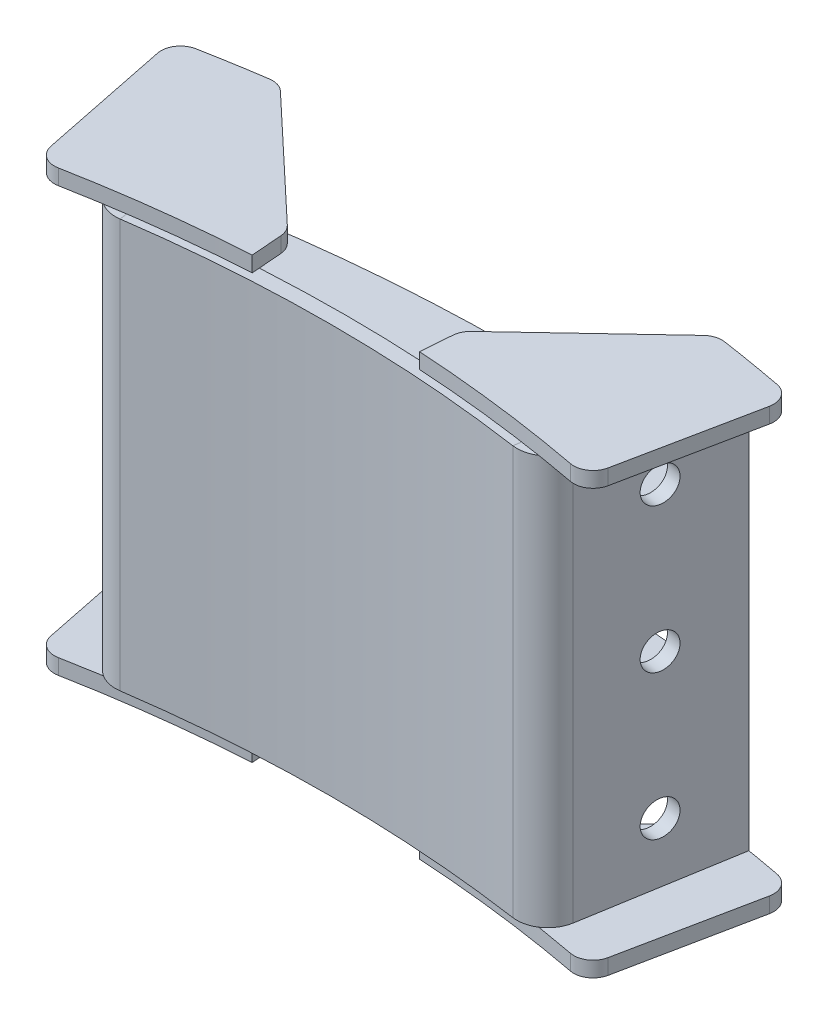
ISO-10303-21;
HEADER;
FILE_DESCRIPTION(('STEP AP214'),'2;1');
FILE_NAME('part.step','',(''),(''),'','','');
FILE_SCHEMA(('AUTOMOTIVE_DESIGN { 1 0 10303 214 1 1 1 1 }'));
ENDSEC;
DATA;
#1=APPLICATION_CONTEXT('core data for automotive mechanical design processes');
#2=APPLICATION_PROTOCOL_DEFINITION('international standard','automotive_design',2000,#1);
#3=PRODUCT_CONTEXT('',#1,'mechanical');
#4=PRODUCT('Part','Part','',(#3));
#5=PRODUCT_RELATED_PRODUCT_CATEGORY('part','',(#4));
#6=PRODUCT_DEFINITION_FORMATION('','',#4);
#7=PRODUCT_DEFINITION_CONTEXT('part definition',#1,'design');
#8=PRODUCT_DEFINITION('design','',#6,#7);
#9=PRODUCT_DEFINITION_SHAPE('','',#8);
#10=(LENGTH_UNIT() NAMED_UNIT(*) SI_UNIT(.MILLI.,.METRE.));
#11=(NAMED_UNIT(*) PLANE_ANGLE_UNIT() SI_UNIT($,.RADIAN.));
#12=(NAMED_UNIT(*) SI_UNIT($,.STERADIAN.) SOLID_ANGLE_UNIT());
#13=UNCERTAINTY_MEASURE_WITH_UNIT(LENGTH_MEASURE(1.E-05),#10,'distance_accuracy_value','');
#14=(GEOMETRIC_REPRESENTATION_CONTEXT(3) GLOBAL_UNCERTAINTY_ASSIGNED_CONTEXT((#13)) GLOBAL_UNIT_ASSIGNED_CONTEXT((#10,
#11,#12)) REPRESENTATION_CONTEXT('',''));
#15=CARTESIAN_POINT('',(0.,0.,0.));
#16=DIRECTION('',(0.,0.,1.));
#17=DIRECTION('',(1.,0.,0.));
#18=AXIS2_PLACEMENT_3D('',#15,#16,#17);
#19=CARTESIAN_POINT('',(0.,-114.,0.));
#20=DIRECTION('',(0.,1.,0.));
#21=DIRECTION('',(0.,0.,-1.));
#22=AXIS2_PLACEMENT_3D('',#19,#20,#21);
#23=CYLINDRICAL_SURFACE('',#22,715.032922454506);
#24=CARTESIAN_POINT('',(0.,-114.,0.));
#25=DIRECTION('',(0.,-1.,0.));
#26=DIRECTION('',(0.,0.,1.));
#27=AXIS2_PLACEMENT_3D('',#24,#25,#26);
#28=CIRCLE('',#27,715.032922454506);
#29=CARTESIAN_POINT('',(43.3920605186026,-114.,-713.715075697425));
#30=VERTEX_POINT('',#29);
#31=CARTESIAN_POINT('',(132.87698573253,-114.,-702.577957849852));
#32=VERTEX_POINT('',#31);
#33=EDGE_CURVE('E144',#30,#32,#28,.T.);
#34=ORIENTED_EDGE('',*,*,#33,.T.);
#35=DIRECTION('',(0.,1.,0.));
#36=VECTOR('',#35,1.);
#37=CARTESIAN_POINT('',(132.87698573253,-114.,-702.577957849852));
#38=LINE('',#37,#36);
#39=CARTESIAN_POINT('',(132.87698573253,-106.,-702.577957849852));
#40=VERTEX_POINT('',#39);
#41=EDGE_CURVE('E147',#32,#40,#38,.T.);
#42=ORIENTED_EDGE('',*,*,#41,.T.);
#43=CARTESIAN_POINT('',(0.,-106.,0.));
#44=DIRECTION('',(0.,-1.,0.));
#45=DIRECTION('',(0.,0.,1.));
#46=AXIS2_PLACEMENT_3D('',#43,#44,#45);
#47=CIRCLE('',#46,715.032922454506);
#48=CARTESIAN_POINT('',(43.3920605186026,-106.,-713.715075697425));
#49=VERTEX_POINT('',#48);
#50=EDGE_CURVE('E146',#49,#40,#47,.T.);
#51=ORIENTED_EDGE('',*,*,#50,.F.);
#52=DIRECTION('',(0.,1.,0.));
#53=VECTOR('',#52,1.);
#54=CARTESIAN_POINT('',(43.3920605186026,-114.,-713.715075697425));
#55=LINE('',#54,#53);
#56=EDGE_CURVE('E135',#30,#49,#55,.T.);
#57=ORIENTED_EDGE('',*,*,#56,.F.);
#58=EDGE_LOOP('',(#34,#42,#51,#57));
#59=FACE_BOUND('',#58,.T.);
#60=ADVANCED_FACE('F59',(#59),#23,.F.);
#61=CARTESIAN_POINT('',(43.5921481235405,-114.,-716.257429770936));
#62=DIRECTION('',(-0.996917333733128,0.,-0.0784590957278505));
#63=DIRECTION('',(0.0784590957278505,0.,-0.996917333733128));
#64=AXIS2_PLACEMENT_3D('',#61,#62,#63);
#65=PLANE('',#64);
#66=DIRECTION('',(-0.0784590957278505,0.,0.996917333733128));
#67=VECTOR('',#66,1.);
#68=CARTESIAN_POINT('',(43.5921481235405,-106.,-716.257429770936));
#69=LINE('',#68,#67);
#70=CARTESIAN_POINT('',(44.6584445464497,-106.,-729.80601042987));
#71=VERTEX_POINT('',#70);
#72=EDGE_CURVE('E154',#71,#49,#69,.T.);
#73=ORIENTED_EDGE('',*,*,#72,.F.);
#74=DIRECTION('',(0.,1.,0.));
#75=VECTOR('',#74,1.);
#76=CARTESIAN_POINT('',(44.6584445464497,-114.,-729.80601042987));
#77=LINE('',#76,#75);
#78=CARTESIAN_POINT('',(44.6584445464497,-114.,-729.80601042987));
#79=VERTEX_POINT('',#78);
#80=EDGE_CURVE('E12',#71,#79,#77,.F.);
#81=ORIENTED_EDGE('',*,*,#80,.T.);
#82=DIRECTION('',(-0.0784590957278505,0.,0.996917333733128));
#83=VECTOR('',#82,1.);
#84=CARTESIAN_POINT('',(43.5921481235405,-114.,-716.257429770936));
#85=LINE('',#84,#83);
#86=EDGE_CURVE('E131',#79,#30,#85,.T.);
#87=ORIENTED_EDGE('',*,*,#86,.T.);
#88=ORIENTED_EDGE('',*,*,#56,.T.);
#89=EDGE_LOOP('',(#73,#81,#87,#88));
#90=FACE_BOUND('',#89,.T.);
#91=ADVANCED_FACE('F134',(#90),#65,.T.);
#92=CARTESIAN_POINT('',(64.7082964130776,-114.,-752.258016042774));
#93=DIRECTION('',(-0.685738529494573,0.,-0.727847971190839));
#94=DIRECTION('',(0.727847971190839,0.,-0.685738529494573));
#95=AXIS2_PLACEMENT_3D('',#92,#93,#94);
#96=PLANE('',#95);
#97=DIRECTION('',(-0.727847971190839,0.,0.685738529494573));
#98=VECTOR('',#97,1.);
#99=CARTESIAN_POINT('',(64.7082964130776,-106.,-752.258016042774));
#100=LINE('',#99,#98);
#101=CARTESIAN_POINT('',(109.747531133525,-106.,-794.691518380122));
#102=VERTEX_POINT('',#101);
#103=CARTESIAN_POINT('',(47.7702325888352,-106.,-736.2998991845));
#104=VERTEX_POINT('',#103);
#105=EDGE_CURVE('E159',#102,#104,#100,.T.);
#106=ORIENTED_EDGE('',*,*,#105,.F.);
#107=DIRECTION('',(0.,-1.,0.));
#108=VECTOR('',#107,1.);
#109=CARTESIAN_POINT('',(109.747531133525,-114.,-794.691518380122));
#110=LINE('',#109,#108);
#111=CARTESIAN_POINT('',(109.747531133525,-114.,-794.691518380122));
#112=VERTEX_POINT('',#111);
#113=EDGE_CURVE('E67',#102,#112,#110,.T.);
#114=ORIENTED_EDGE('',*,*,#113,.T.);
#115=DIRECTION('',(-0.727847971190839,0.,0.685738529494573));
#116=VECTOR('',#115,1.);
#117=CARTESIAN_POINT('',(64.7082964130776,-114.,-752.258016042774));
#118=LINE('',#117,#116);
#119=CARTESIAN_POINT('',(47.7702325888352,-114.,-736.2998991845));
#120=VERTEX_POINT('',#119);
#121=EDGE_CURVE('E139',#112,#120,#118,.T.);
#122=ORIENTED_EDGE('',*,*,#121,.T.);
#123=DIRECTION('',(0.,1.,0.));
#124=VECTOR('',#123,1.);
#125=CARTESIAN_POINT('',(47.7702325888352,-114.,-736.2998991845));
#126=LINE('',#125,#124);
#127=EDGE_CURVE('E200',#120,#104,#126,.T.);
#128=ORIENTED_EDGE('',*,*,#127,.T.);
#129=EDGE_LOOP('',(#106,#114,#122,#128));
#130=FACE_BOUND('',#129,.T.);
#131=ADVANCED_FACE('F206',(#130),#96,.T.);
#132=CARTESIAN_POINT('',(0.,-114.,0.));
#133=DIRECTION('',(0.,1.,0.));
#134=DIRECTION('',(0.,0.,-1.));
#135=AXIS2_PLACEMENT_3D('',#132,#133,#134);
#136=CYLINDRICAL_SURFACE('',#135,806.);
#137=CARTESIAN_POINT('',(0.,-106.,0.));
#138=DIRECTION('',(0.,-1.,0.));
#139=DIRECTION('',(0.,0.,1.));
#140=AXIS2_PLACEMENT_3D('',#137,#138,#139);
#141=CIRCLE('',#140,806.);
#142=CARTESIAN_POINT('',(118.06980231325,-106.,-797.305162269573));
#143=VERTEX_POINT('',#142);
#144=CARTESIAN_POINT('',(150.755521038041,-106.,-791.775708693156));
#145=VERTEX_POINT('',#144);
#146=EDGE_CURVE('E169',#143,#145,#141,.T.);
#147=ORIENTED_EDGE('',*,*,#146,.T.);
#148=DIRECTION('',(0.,1.,0.));
#149=VECTOR('',#148,1.);
#150=CARTESIAN_POINT('',(150.755521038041,-114.,-791.775708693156));
#151=LINE('',#150,#149);
#152=CARTESIAN_POINT('',(150.755521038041,-114.,-791.775708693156));
#153=VERTEX_POINT('',#152);
#154=EDGE_CURVE('E197',#145,#153,#151,.F.);
#155=ORIENTED_EDGE('',*,*,#154,.T.);
#156=CARTESIAN_POINT('',(0.,-114.,0.));
#157=DIRECTION('',(0.,-1.,0.));
#158=DIRECTION('',(0.,0.,1.));
#159=AXIS2_PLACEMENT_3D('',#156,#157,#158);
#160=CIRCLE('',#159,806.);
#161=CARTESIAN_POINT('',(118.06980231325,-114.,-797.305162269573));
#162=VERTEX_POINT('',#161);
#163=EDGE_CURVE('E157',#162,#153,#160,.T.);
#164=ORIENTED_EDGE('',*,*,#163,.F.);
#165=DIRECTION('',(0.,1.,0.));
#166=VECTOR('',#165,1.);
#167=CARTESIAN_POINT('',(118.06980231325,-114.,-797.305162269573));
#168=LINE('',#167,#166);
#169=EDGE_CURVE('E194',#162,#143,#168,.T.);
#170=ORIENTED_EDGE('',*,*,#169,.T.);
#171=EDGE_LOOP('',(#147,#155,#164,#170));
#172=FACE_BOUND('',#171,.T.);
#173=ADVANCED_FACE('F216',(#172),#136,.T.);
#174=CARTESIAN_POINT('',(143.113423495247,-114.,-703.424949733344));
#175=DIRECTION('',(0.97992470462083,0.,0.199367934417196));
#176=DIRECTION('',(-0.199367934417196,0.,0.97992470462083));
#177=AXIS2_PLACEMENT_3D('',#174,#175,#176);
#178=PLANE('',#177);
#179=DIRECTION('',(0.199367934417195,0.,-0.97992470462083));
#180=VECTOR('',#179,1.);
#181=CARTESIAN_POINT('',(143.113423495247,-106.,-703.424949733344));
#182=LINE('',#181,#180);
#183=CARTESIAN_POINT('',(144.534566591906,-106.,-710.410091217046));
#184=VERTEX_POINT('',#183);
#185=CARTESIAN_POINT('',(158.684352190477,-106.,-779.958509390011));
#186=VERTEX_POINT('',#185);
#187=EDGE_CURVE('E166',#184,#186,#182,.T.);
#188=ORIENTED_EDGE('',*,*,#187,.F.);
#189=DIRECTION('',(0.,1.,0.));
#190=VECTOR('',#189,1.);
#191=CARTESIAN_POINT('',(144.534566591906,-114.,-710.410091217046));
#192=LINE('',#191,#190);
#193=CARTESIAN_POINT('',(144.534566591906,-114.,-710.410091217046));
#194=VERTEX_POINT('',#193);
#195=EDGE_CURVE('E186',#184,#194,#192,.F.);
#196=ORIENTED_EDGE('',*,*,#195,.T.);
#197=DIRECTION('',(0.199367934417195,0.,-0.97992470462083));
#198=VECTOR('',#197,1.);
#199=CARTESIAN_POINT('',(143.113423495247,-114.,-703.424949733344));
#200=LINE('',#199,#198);
#201=CARTESIAN_POINT('',(158.684352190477,-114.,-779.958509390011));
#202=VERTEX_POINT('',#201);
#203=EDGE_CURVE('E153',#194,#202,#200,.T.);
#204=ORIENTED_EDGE('',*,*,#203,.T.);
#205=DIRECTION('',(0.,-1.,0.));
#206=VECTOR('',#205,1.);
#207=CARTESIAN_POINT('',(158.684352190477,-106.,-779.958509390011));
#208=LINE('',#207,#206);
#209=EDGE_CURVE('E183',#202,#186,#208,.F.);
#210=ORIENTED_EDGE('',*,*,#209,.T.);
#211=EDGE_LOOP('',(#188,#196,#204,#210));
#212=FACE_BOUND('',#211,.T.);
#213=ADVANCED_FACE('F220',(#212),#178,.T.);
#214=CARTESIAN_POINT('',(0.,-114.,0.));
#215=DIRECTION('',(0.,-1.,0.));
#216=DIRECTION('',(0.,0.,1.));
#217=AXIS2_PLACEMENT_3D('',#214,#215,#216);
#218=PLANE('',#217);
#219=ORIENTED_EDGE('',*,*,#203,.F.);
#220=CARTESIAN_POINT('',(134.735319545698,-114.,-712.403770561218));
#221=DIRECTION('',(0.,-1.,0.));
#222=DIRECTION('',(0.,0.,1.));
#223=AXIS2_PLACEMENT_3D('',#220,#221,#222);
#224=CIRCLE('',#223,10.);
#225=EDGE_CURVE('E151',#194,#32,#224,.T.);
#226=ORIENTED_EDGE('',*,*,#225,.T.);
#227=ORIENTED_EDGE('',*,*,#33,.F.);
#228=ORIENTED_EDGE('',*,*,#86,.F.);
#229=CARTESIAN_POINT('',(54.6276178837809,-114.,-729.021419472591));
#230=DIRECTION('',(0.,-1.,0.));
#231=DIRECTION('',(0.,0.,1.));
#232=AXIS2_PLACEMENT_3D('',#229,#230,#231);
#233=CIRCLE('',#232,10.);
#234=EDGE_CURVE('E189',#79,#120,#233,.T.);
#235=ORIENTED_EDGE('',*,*,#234,.T.);
#236=ORIENTED_EDGE('',*,*,#121,.F.);
#237=CARTESIAN_POINT('',(116.604916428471,-114.,-787.413038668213));
#238=DIRECTION('',(0.,-1.,0.));
#239=DIRECTION('',(0.,0.,1.));
#240=AXIS2_PLACEMENT_3D('',#237,#238,#239);
#241=CIRCLE('',#240,10.);
#242=EDGE_CURVE('E81',#112,#162,#241,.T.);
#243=ORIENTED_EDGE('',*,*,#242,.T.);
#244=ORIENTED_EDGE('',*,*,#163,.T.);
#245=CARTESIAN_POINT('',(148.885105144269,-114.,-781.952188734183));
#246=DIRECTION('',(0.,-1.,0.));
#247=DIRECTION('',(0.,0.,1.));
#248=AXIS2_PLACEMENT_3D('',#245,#246,#247);
#249=CIRCLE('',#248,10.);
#250=EDGE_CURVE('E74',#153,#202,#249,.T.);
#251=ORIENTED_EDGE('',*,*,#250,.T.);
#252=EDGE_LOOP('',(#219,#226,#227,#228,#235,#236,#243,#244,#251));
#253=FACE_BOUND('',#252,.T.);
#254=ADVANCED_FACE('F150',(#253),#218,.T.);
#255=CARTESIAN_POINT('',(0.,-106.,0.));
#256=DIRECTION('',(0.,-1.,0.));
#257=DIRECTION('',(0.,0.,1.));
#258=AXIS2_PLACEMENT_3D('',#255,#256,#257);
#259=PLANE('',#258);
#260=ORIENTED_EDGE('',*,*,#50,.T.);
#261=CARTESIAN_POINT('',(134.735319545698,-106.,-712.403770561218));
#262=DIRECTION('',(0.,-1.,0.));
#263=DIRECTION('',(0.,0.,1.));
#264=AXIS2_PLACEMENT_3D('',#261,#262,#263);
#265=CIRCLE('',#264,10.);
#266=EDGE_CURVE('E181',#40,#184,#265,.F.);
#267=ORIENTED_EDGE('',*,*,#266,.T.);
#268=ORIENTED_EDGE('',*,*,#187,.T.);
#269=CARTESIAN_POINT('',(148.885105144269,-106.,-781.952188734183));
#270=DIRECTION('',(0.,-1.,0.));
#271=DIRECTION('',(0.,0.,1.));
#272=AXIS2_PLACEMENT_3D('',#269,#270,#271);
#273=CIRCLE('',#272,10.);
#274=EDGE_CURVE('E179',#186,#145,#273,.F.);
#275=ORIENTED_EDGE('',*,*,#274,.T.);
#276=ORIENTED_EDGE('',*,*,#146,.F.);
#277=CARTESIAN_POINT('',(116.604916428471,-106.,-787.413038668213));
#278=DIRECTION('',(0.,-1.,0.));
#279=DIRECTION('',(0.,0.,1.));
#280=AXIS2_PLACEMENT_3D('',#277,#278,#279);
#281=CIRCLE('',#280,10.);
#282=EDGE_CURVE('E177',#143,#102,#281,.F.);
#283=ORIENTED_EDGE('',*,*,#282,.T.);
#284=ORIENTED_EDGE('',*,*,#105,.T.);
#285=CARTESIAN_POINT('',(54.6276178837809,-106.,-729.021419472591));
#286=DIRECTION('',(0.,-1.,0.));
#287=DIRECTION('',(0.,0.,1.));
#288=AXIS2_PLACEMENT_3D('',#285,#286,#287);
#289=CIRCLE('',#288,10.);
#290=EDGE_CURVE('E175',#104,#71,#289,.F.);
#291=ORIENTED_EDGE('',*,*,#290,.T.);
#292=ORIENTED_EDGE('',*,*,#72,.T.);
#293=EDGE_LOOP('',(#260,#267,#268,#275,#276,#283,#284,#291,#292));
#294=FACE_BOUND('',#293,.T.);
#295=ADVANCED_FACE('F213',(#294),#259,.F.);
#296=CARTESIAN_POINT('',(134.735319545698,-114.,-712.403770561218));
#297=DIRECTION('',(0.,1.,0.));
#298=DIRECTION('',(0.,0.,-1.));
#299=AXIS2_PLACEMENT_3D('',#296,#297,#298);
#300=CYLINDRICAL_SURFACE('',#299,10.);
#301=ORIENTED_EDGE('',*,*,#225,.F.);
#302=ORIENTED_EDGE('',*,*,#195,.F.);
#303=ORIENTED_EDGE('',*,*,#266,.F.);
#304=ORIENTED_EDGE('',*,*,#41,.F.);
#305=EDGE_LOOP('',(#301,#302,#303,#304));
#306=FACE_BOUND('',#305,.T.);
#307=ADVANCED_FACE('F223',(#306),#300,.T.);
#308=CARTESIAN_POINT('',(148.885105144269,-114.,-781.952188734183));
#309=DIRECTION('',(0.,1.,0.));
#310=DIRECTION('',(0.,0.,-1.));
#311=AXIS2_PLACEMENT_3D('',#308,#309,#310);
#312=CYLINDRICAL_SURFACE('',#311,10.);
#313=ORIENTED_EDGE('',*,*,#250,.F.);
#314=ORIENTED_EDGE('',*,*,#154,.F.);
#315=ORIENTED_EDGE('',*,*,#274,.F.);
#316=ORIENTED_EDGE('',*,*,#209,.F.);
#317=EDGE_LOOP('',(#313,#314,#315,#316));
#318=FACE_BOUND('',#317,.T.);
#319=ADVANCED_FACE('F217',(#318),#312,.T.);
#320=CARTESIAN_POINT('',(116.604916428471,-114.,-787.413038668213));
#321=DIRECTION('',(0.,1.,0.));
#322=DIRECTION('',(0.,0.,-1.));
#323=AXIS2_PLACEMENT_3D('',#320,#321,#322);
#324=CYLINDRICAL_SURFACE('',#323,10.);
#325=ORIENTED_EDGE('',*,*,#242,.F.);
#326=ORIENTED_EDGE('',*,*,#113,.F.);
#327=ORIENTED_EDGE('',*,*,#282,.F.);
#328=ORIENTED_EDGE('',*,*,#169,.F.);
#329=EDGE_LOOP('',(#325,#326,#327,#328));
#330=FACE_BOUND('',#329,.T.);
#331=ADVANCED_FACE('F208',(#330),#324,.T.);
#332=CARTESIAN_POINT('',(54.6276178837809,-114.,-729.021419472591));
#333=DIRECTION('',(0.,1.,0.));
#334=DIRECTION('',(0.,0.,-1.));
#335=AXIS2_PLACEMENT_3D('',#332,#333,#334);
#336=CYLINDRICAL_SURFACE('',#335,10.);
#337=ORIENTED_EDGE('',*,*,#234,.F.);
#338=ORIENTED_EDGE('',*,*,#80,.F.);
#339=ORIENTED_EDGE('',*,*,#290,.F.);
#340=ORIENTED_EDGE('',*,*,#127,.F.);
#341=EDGE_LOOP('',(#337,#338,#339,#340));
#342=FACE_BOUND('',#341,.T.);
#343=ADVANCED_FACE('F61',(#342),#336,.T.);
#344=CLOSED_SHELL('',(#60,#91,#131,#173,#213,#254,#295,#307,#319,#331,#343));
#345=MANIFOLD_SOLID_BREP('B2',#344);
#346=CARTESIAN_POINT('',(0.,114.,0.));
#347=DIRECTION('',(0.,-1.,0.));
#348=DIRECTION('',(0.,0.,-1.));
#349=AXIS2_PLACEMENT_3D('',#346,#347,#348);
#350=CYLINDRICAL_SURFACE('',#349,715.032922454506);
#351=CARTESIAN_POINT('',(0.,114.,0.));
#352=DIRECTION('',(0.,-1.,0.));
#353=DIRECTION('',(0.,0.,1.));
#354=AXIS2_PLACEMENT_3D('',#351,#352,#353);
#355=CIRCLE('',#354,715.032922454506);
#356=CARTESIAN_POINT('',(43.3920605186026,114.,-713.715075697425));
#357=VERTEX_POINT('',#356);
#358=CARTESIAN_POINT('',(132.87698573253,114.,-702.577957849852));
#359=VERTEX_POINT('',#358);
#360=EDGE_CURVE('E397',#357,#359,#355,.T.);
#361=ORIENTED_EDGE('',*,*,#360,.F.);
#362=DIRECTION('',(0.,-1.,0.));
#363=VECTOR('',#362,1.);
#364=CARTESIAN_POINT('',(43.3920605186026,114.,-713.715075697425));
#365=LINE('',#364,#363);
#366=CARTESIAN_POINT('',(43.3920605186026,106.,-713.715075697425));
#367=VERTEX_POINT('',#366);
#368=EDGE_CURVE('E402',#357,#367,#365,.T.);
#369=ORIENTED_EDGE('',*,*,#368,.T.);
#370=CARTESIAN_POINT('',(0.,106.,0.));
#371=DIRECTION('',(0.,-1.,0.));
#372=DIRECTION('',(0.,0.,1.));
#373=AXIS2_PLACEMENT_3D('',#370,#371,#372);
#374=CIRCLE('',#373,715.032922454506);
#375=CARTESIAN_POINT('',(132.87698573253,106.,-702.577957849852));
#376=VERTEX_POINT('',#375);
#377=EDGE_CURVE('E426',#367,#376,#374,.T.);
#378=ORIENTED_EDGE('',*,*,#377,.T.);
#379=DIRECTION('',(0.,-1.,0.));
#380=VECTOR('',#379,1.);
#381=CARTESIAN_POINT('',(132.87698573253,114.,-702.577957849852));
#382=LINE('',#381,#380);
#383=EDGE_CURVE('E412',#359,#376,#382,.T.);
#384=ORIENTED_EDGE('',*,*,#383,.F.);
#385=EDGE_LOOP('',(#361,#369,#378,#384));
#386=FACE_BOUND('',#385,.T.);
#387=ADVANCED_FACE('F322',(#386),#350,.F.);
#388=CARTESIAN_POINT('',(43.5921481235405,114.,-716.257429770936));
#389=DIRECTION('',(-0.996917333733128,0.,-0.0784590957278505));
#390=DIRECTION('',(0.0784590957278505,0.,-0.996917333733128));
#391=AXIS2_PLACEMENT_3D('',#388,#389,#390);
#392=PLANE('',#391);
#393=DIRECTION('',(-0.0784590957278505,0.,0.996917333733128));
#394=VECTOR('',#393,1.);
#395=CARTESIAN_POINT('',(43.5921481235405,106.,-716.257429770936));
#396=LINE('',#395,#394);
#397=CARTESIAN_POINT('',(44.6584445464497,106.,-729.80601042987));
#398=VERTEX_POINT('',#397);
#399=EDGE_CURVE('E408',#398,#367,#396,.T.);
#400=ORIENTED_EDGE('',*,*,#399,.T.);
#401=ORIENTED_EDGE('',*,*,#368,.F.);
#402=DIRECTION('',(-0.0784590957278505,0.,0.996917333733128));
#403=VECTOR('',#402,1.);
#404=CARTESIAN_POINT('',(43.5921481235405,114.,-716.257429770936));
#405=LINE('',#404,#403);
#406=CARTESIAN_POINT('',(44.6584445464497,114.,-729.80601042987));
#407=VERTEX_POINT('',#406);
#408=EDGE_CURVE('E393',#407,#357,#405,.T.);
#409=ORIENTED_EDGE('',*,*,#408,.F.);
#410=DIRECTION('',(0.,-1.,0.));
#411=VECTOR('',#410,1.);
#412=CARTESIAN_POINT('',(44.6584445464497,114.,-729.80601042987));
#413=LINE('',#412,#411);
#414=EDGE_CURVE('E57',#398,#407,#413,.F.);
#415=ORIENTED_EDGE('',*,*,#414,.F.);
#416=EDGE_LOOP('',(#400,#401,#409,#415));
#417=FACE_BOUND('',#416,.T.);
#418=ADVANCED_FACE('F406',(#417),#392,.T.);
#419=CARTESIAN_POINT('',(64.7082964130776,114.,-752.258016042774));
#420=DIRECTION('',(-0.685738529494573,0.,-0.727847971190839));
#421=DIRECTION('',(0.727847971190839,0.,-0.685738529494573));
#422=AXIS2_PLACEMENT_3D('',#419,#420,#421);
#423=PLANE('',#422);
#424=DIRECTION('',(-0.727847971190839,0.,0.685738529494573));
#425=VECTOR('',#424,1.);
#426=CARTESIAN_POINT('',(64.7082964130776,106.,-752.258016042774));
#427=LINE('',#426,#425);
#428=CARTESIAN_POINT('',(109.747531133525,106.,-794.691518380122));
#429=VERTEX_POINT('',#428);
#430=CARTESIAN_POINT('',(47.7702325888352,106.,-736.2998991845));
#431=VERTEX_POINT('',#430);
#432=EDGE_CURVE('E420',#429,#431,#427,.T.);
#433=ORIENTED_EDGE('',*,*,#432,.T.);
#434=DIRECTION('',(0.,-1.,0.));
#435=VECTOR('',#434,1.);
#436=CARTESIAN_POINT('',(47.7702325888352,114.,-736.2998991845));
#437=LINE('',#436,#435);
#438=CARTESIAN_POINT('',(47.7702325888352,114.,-736.2998991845));
#439=VERTEX_POINT('',#438);
#440=EDGE_CURVE('E460',#439,#431,#437,.T.);
#441=ORIENTED_EDGE('',*,*,#440,.F.);
#442=DIRECTION('',(-0.727847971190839,0.,0.685738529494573));
#443=VECTOR('',#442,1.);
#444=CARTESIAN_POINT('',(64.7082964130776,114.,-752.258016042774));
#445=LINE('',#444,#443);
#446=CARTESIAN_POINT('',(109.747531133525,114.,-794.691518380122));
#447=VERTEX_POINT('',#446);
#448=EDGE_CURVE('E403',#447,#439,#445,.T.);
#449=ORIENTED_EDGE('',*,*,#448,.F.);
#450=DIRECTION('',(0.,1.,0.));
#451=VECTOR('',#450,1.);
#452=CARTESIAN_POINT('',(109.747531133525,114.,-794.691518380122));
#453=LINE('',#452,#451);
#454=EDGE_CURVE('E330',#429,#447,#453,.T.);
#455=ORIENTED_EDGE('',*,*,#454,.F.);
#456=EDGE_LOOP('',(#433,#441,#449,#455));
#457=FACE_BOUND('',#456,.T.);
#458=ADVANCED_FACE('F468',(#457),#423,.T.);
#459=CARTESIAN_POINT('',(0.,114.,0.));
#460=DIRECTION('',(0.,-1.,0.));
#461=DIRECTION('',(0.,0.,-1.));
#462=AXIS2_PLACEMENT_3D('',#459,#460,#461);
#463=CYLINDRICAL_SURFACE('',#462,806.);
#464=CARTESIAN_POINT('',(0.,106.,0.));
#465=DIRECTION('',(0.,-1.,0.));
#466=DIRECTION('',(0.,0.,1.));
#467=AXIS2_PLACEMENT_3D('',#464,#465,#466);
#468=CIRCLE('',#467,806.);
#469=CARTESIAN_POINT('',(118.06980231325,106.,-797.305162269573));
#470=VERTEX_POINT('',#469);
#471=CARTESIAN_POINT('',(150.755521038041,106.,-791.775708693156));
#472=VERTEX_POINT('',#471);
#473=EDGE_CURVE('E431',#470,#472,#468,.T.);
#474=ORIENTED_EDGE('',*,*,#473,.F.);
#475=DIRECTION('',(0.,-1.,0.));
#476=VECTOR('',#475,1.);
#477=CARTESIAN_POINT('',(118.06980231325,114.,-797.305162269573));
#478=LINE('',#477,#476);
#479=CARTESIAN_POINT('',(118.06980231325,114.,-797.305162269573));
#480=VERTEX_POINT('',#479);
#481=EDGE_CURVE('E456',#480,#470,#478,.T.);
#482=ORIENTED_EDGE('',*,*,#481,.F.);
#483=CARTESIAN_POINT('',(0.,114.,0.));
#484=DIRECTION('',(0.,-1.,0.));
#485=DIRECTION('',(0.,0.,1.));
#486=AXIS2_PLACEMENT_3D('',#483,#484,#485);
#487=CIRCLE('',#486,806.);
#488=CARTESIAN_POINT('',(150.755521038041,114.,-791.775708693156));
#489=VERTEX_POINT('',#488);
#490=EDGE_CURVE('E418',#480,#489,#487,.T.);
#491=ORIENTED_EDGE('',*,*,#490,.T.);
#492=DIRECTION('',(0.,-1.,0.));
#493=VECTOR('',#492,1.);
#494=CARTESIAN_POINT('',(150.755521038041,114.,-791.775708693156));
#495=LINE('',#494,#493);
#496=EDGE_CURVE('E458',#472,#489,#495,.F.);
#497=ORIENTED_EDGE('',*,*,#496,.F.);
#498=EDGE_LOOP('',(#474,#482,#491,#497));
#499=FACE_BOUND('',#498,.T.);
#500=ADVANCED_FACE('F473',(#499),#463,.T.);
#501=CARTESIAN_POINT('',(143.113423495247,114.,-703.424949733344));
#502=DIRECTION('',(0.97992470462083,0.,0.199367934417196));
#503=DIRECTION('',(-0.199367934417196,0.,0.97992470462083));
#504=AXIS2_PLACEMENT_3D('',#501,#502,#503);
#505=PLANE('',#504);
#506=DIRECTION('',(0.199367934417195,0.,-0.97992470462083));
#507=VECTOR('',#506,1.);
#508=CARTESIAN_POINT('',(143.113423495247,106.,-703.424949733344));
#509=LINE('',#508,#507);
#510=CARTESIAN_POINT('',(144.534566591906,106.,-710.410091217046));
#511=VERTEX_POINT('',#510);
#512=CARTESIAN_POINT('',(158.684352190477,106.,-779.958509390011));
#513=VERTEX_POINT('',#512);
#514=EDGE_CURVE('E428',#511,#513,#509,.T.);
#515=ORIENTED_EDGE('',*,*,#514,.T.);
#516=DIRECTION('',(0.,1.,0.));
#517=VECTOR('',#516,1.);
#518=CARTESIAN_POINT('',(158.684352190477,106.,-779.958509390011));
#519=LINE('',#518,#517);
#520=CARTESIAN_POINT('',(158.684352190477,114.,-779.958509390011));
#521=VERTEX_POINT('',#520);
#522=EDGE_CURVE('E445',#521,#513,#519,.F.);
#523=ORIENTED_EDGE('',*,*,#522,.F.);
#524=DIRECTION('',(0.199367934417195,0.,-0.97992470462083));
#525=VECTOR('',#524,1.);
#526=CARTESIAN_POINT('',(143.113423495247,114.,-703.424949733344));
#527=LINE('',#526,#525);
#528=CARTESIAN_POINT('',(144.534566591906,114.,-710.410091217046));
#529=VERTEX_POINT('',#528);
#530=EDGE_CURVE('E416',#529,#521,#527,.T.);
#531=ORIENTED_EDGE('',*,*,#530,.F.);
#532=DIRECTION('',(0.,-1.,0.));
#533=VECTOR('',#532,1.);
#534=CARTESIAN_POINT('',(144.534566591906,114.,-710.410091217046));
#535=LINE('',#534,#533);
#536=EDGE_CURVE('E448',#511,#529,#535,.F.);
#537=ORIENTED_EDGE('',*,*,#536,.F.);
#538=EDGE_LOOP('',(#515,#523,#531,#537));
#539=FACE_BOUND('',#538,.T.);
#540=ADVANCED_FACE('F491',(#539),#505,.T.);
#541=CARTESIAN_POINT('',(0.,114.,0.));
#542=DIRECTION('',(0.,1.,0.));
#543=DIRECTION('',(0.,0.,1.));
#544=AXIS2_PLACEMENT_3D('',#541,#542,#543);
#545=PLANE('',#544);
#546=ORIENTED_EDGE('',*,*,#530,.T.);
#547=CARTESIAN_POINT('',(148.885105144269,114.,-781.952188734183));
#548=DIRECTION('',(0.,-1.,0.));
#549=DIRECTION('',(0.,0.,1.));
#550=AXIS2_PLACEMENT_3D('',#547,#548,#549);
#551=CIRCLE('',#550,10.);
#552=EDGE_CURVE('E337',#489,#521,#551,.T.);
#553=ORIENTED_EDGE('',*,*,#552,.F.);
#554=ORIENTED_EDGE('',*,*,#490,.F.);
#555=CARTESIAN_POINT('',(116.604916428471,114.,-787.413038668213));
#556=DIRECTION('',(0.,-1.,0.));
#557=DIRECTION('',(0.,0.,1.));
#558=AXIS2_PLACEMENT_3D('',#555,#556,#557);
#559=CIRCLE('',#558,10.);
#560=EDGE_CURVE('E345',#447,#480,#559,.T.);
#561=ORIENTED_EDGE('',*,*,#560,.F.);
#562=ORIENTED_EDGE('',*,*,#448,.T.);
#563=CARTESIAN_POINT('',(54.6276178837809,114.,-729.021419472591));
#564=DIRECTION('',(0.,-1.,0.));
#565=DIRECTION('',(0.,0.,1.));
#566=AXIS2_PLACEMENT_3D('',#563,#564,#565);
#567=CIRCLE('',#566,10.);
#568=EDGE_CURVE('E399',#407,#439,#567,.T.);
#569=ORIENTED_EDGE('',*,*,#568,.F.);
#570=ORIENTED_EDGE('',*,*,#408,.T.);
#571=ORIENTED_EDGE('',*,*,#360,.T.);
#572=CARTESIAN_POINT('',(134.735319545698,114.,-712.403770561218));
#573=DIRECTION('',(0.,-1.,0.));
#574=DIRECTION('',(0.,0.,1.));
#575=AXIS2_PLACEMENT_3D('',#572,#573,#574);
#576=CIRCLE('',#575,10.);
#577=EDGE_CURVE('E454',#529,#359,#576,.T.);
#578=ORIENTED_EDGE('',*,*,#577,.F.);
#579=EDGE_LOOP('',(#546,#553,#554,#561,#562,#569,#570,#571,#578));
#580=FACE_BOUND('',#579,.T.);
#581=ADVANCED_FACE('F395',(#580),#545,.T.);
#582=CARTESIAN_POINT('',(0.,106.,0.));
#583=DIRECTION('',(0.,1.,0.));
#584=DIRECTION('',(0.,0.,1.));
#585=AXIS2_PLACEMENT_3D('',#582,#583,#584);
#586=PLANE('',#585);
#587=ORIENTED_EDGE('',*,*,#377,.F.);
#588=ORIENTED_EDGE('',*,*,#399,.F.);
#589=CARTESIAN_POINT('',(54.6276178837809,106.,-729.021419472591));
#590=DIRECTION('',(0.,-1.,0.));
#591=DIRECTION('',(0.,0.,1.));
#592=AXIS2_PLACEMENT_3D('',#589,#590,#591);
#593=CIRCLE('',#592,10.);
#594=EDGE_CURVE('E437',#431,#398,#593,.F.);
#595=ORIENTED_EDGE('',*,*,#594,.F.);
#596=ORIENTED_EDGE('',*,*,#432,.F.);
#597=CARTESIAN_POINT('',(116.604916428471,106.,-787.413038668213));
#598=DIRECTION('',(0.,-1.,0.));
#599=DIRECTION('',(0.,0.,1.));
#600=AXIS2_PLACEMENT_3D('',#597,#598,#599);
#601=CIRCLE('',#600,10.);
#602=EDGE_CURVE('E439',#470,#429,#601,.F.);
#603=ORIENTED_EDGE('',*,*,#602,.F.);
#604=ORIENTED_EDGE('',*,*,#473,.T.);
#605=CARTESIAN_POINT('',(148.885105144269,106.,-781.952188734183));
#606=DIRECTION('',(0.,-1.,0.));
#607=DIRECTION('',(0.,0.,1.));
#608=AXIS2_PLACEMENT_3D('',#605,#606,#607);
#609=CIRCLE('',#608,10.);
#610=EDGE_CURVE('E441',#513,#472,#609,.F.);
#611=ORIENTED_EDGE('',*,*,#610,.F.);
#612=ORIENTED_EDGE('',*,*,#514,.F.);
#613=CARTESIAN_POINT('',(134.735319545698,106.,-712.403770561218));
#614=DIRECTION('',(0.,-1.,0.));
#615=DIRECTION('',(0.,0.,1.));
#616=AXIS2_PLACEMENT_3D('',#613,#614,#615);
#617=CIRCLE('',#616,10.);
#618=EDGE_CURVE('E443',#376,#511,#617,.F.);
#619=ORIENTED_EDGE('',*,*,#618,.F.);
#620=EDGE_LOOP('',(#587,#588,#595,#596,#603,#604,#611,#612,#619));
#621=FACE_BOUND('',#620,.T.);
#622=ADVANCED_FACE('F475',(#621),#586,.F.);
#623=CARTESIAN_POINT('',(134.735319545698,114.,-712.403770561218));
#624=DIRECTION('',(0.,-1.,0.));
#625=DIRECTION('',(0.,0.,-1.));
#626=AXIS2_PLACEMENT_3D('',#623,#624,#625);
#627=CYLINDRICAL_SURFACE('',#626,10.);
#628=ORIENTED_EDGE('',*,*,#577,.T.);
#629=ORIENTED_EDGE('',*,*,#383,.T.);
#630=ORIENTED_EDGE('',*,*,#618,.T.);
#631=ORIENTED_EDGE('',*,*,#536,.T.);
#632=EDGE_LOOP('',(#628,#629,#630,#631));
#633=FACE_BOUND('',#632,.T.);
#634=ADVANCED_FACE('F493',(#633),#627,.T.);
#635=CARTESIAN_POINT('',(148.885105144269,114.,-781.952188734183));
#636=DIRECTION('',(0.,-1.,0.));
#637=DIRECTION('',(0.,0.,-1.));
#638=AXIS2_PLACEMENT_3D('',#635,#636,#637);
#639=CYLINDRICAL_SURFACE('',#638,10.);
#640=ORIENTED_EDGE('',*,*,#552,.T.);
#641=ORIENTED_EDGE('',*,*,#522,.T.);
#642=ORIENTED_EDGE('',*,*,#610,.T.);
#643=ORIENTED_EDGE('',*,*,#496,.T.);
#644=EDGE_LOOP('',(#640,#641,#642,#643));
#645=FACE_BOUND('',#644,.T.);
#646=ADVANCED_FACE('F482',(#645),#639,.T.);
#647=CARTESIAN_POINT('',(116.604916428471,114.,-787.413038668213));
#648=DIRECTION('',(0.,-1.,0.));
#649=DIRECTION('',(0.,0.,-1.));
#650=AXIS2_PLACEMENT_3D('',#647,#648,#649);
#651=CYLINDRICAL_SURFACE('',#650,10.);
#652=ORIENTED_EDGE('',*,*,#560,.T.);
#653=ORIENTED_EDGE('',*,*,#481,.T.);
#654=ORIENTED_EDGE('',*,*,#602,.T.);
#655=ORIENTED_EDGE('',*,*,#454,.T.);
#656=EDGE_LOOP('',(#652,#653,#654,#655));
#657=FACE_BOUND('',#656,.T.);
#658=ADVANCED_FACE('F464',(#657),#651,.T.);
#659=CARTESIAN_POINT('',(54.6276178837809,114.,-729.021419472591));
#660=DIRECTION('',(0.,-1.,0.));
#661=DIRECTION('',(0.,0.,-1.));
#662=AXIS2_PLACEMENT_3D('',#659,#660,#661);
#663=CYLINDRICAL_SURFACE('',#662,10.);
#664=ORIENTED_EDGE('',*,*,#568,.T.);
#665=ORIENTED_EDGE('',*,*,#440,.T.);
#666=ORIENTED_EDGE('',*,*,#594,.T.);
#667=ORIENTED_EDGE('',*,*,#414,.T.);
#668=EDGE_LOOP('',(#664,#665,#666,#667));
#669=FACE_BOUND('',#668,.T.);
#670=ADVANCED_FACE('F324',(#669),#663,.T.);
#671=CLOSED_SHELL('',(#387,#418,#458,#500,#540,#581,#622,#634,#646,#658,#670));
#672=MANIFOLD_SOLID_BREP('B6',#671);
#673=CARTESIAN_POINT('',(0.,-114.,0.));
#674=DIRECTION('',(0.,1.,0.));
#675=DIRECTION('',(0.,0.,-1.));
#676=AXIS2_PLACEMENT_3D('',#673,#674,#675);
#677=CYLINDRICAL_SURFACE('',#676,715.032922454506);
#678=CARTESIAN_POINT('',(0.,-114.,0.));
#679=DIRECTION('',(0.,1.,0.));
#680=DIRECTION('',(0.,0.,1.));
#681=AXIS2_PLACEMENT_3D('',#678,#679,#680);
#682=CIRCLE('',#681,715.032922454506);
#683=CARTESIAN_POINT('',(-43.3920605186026,-114.,-713.715075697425));
#684=VERTEX_POINT('',#683);
#685=CARTESIAN_POINT('',(-132.87698573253,-114.,-702.577957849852));
#686=VERTEX_POINT('',#685);
#687=EDGE_CURVE('E660',#684,#686,#682,.T.);
#688=ORIENTED_EDGE('',*,*,#687,.F.);
#689=DIRECTION('',(0.,1.,0.));
#690=VECTOR('',#689,1.);
#691=CARTESIAN_POINT('',(-43.3920605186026,-114.,-713.715075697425));
#692=LINE('',#691,#690);
#693=CARTESIAN_POINT('',(-43.3920605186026,-106.,-713.715075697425));
#694=VERTEX_POINT('',#693);
#695=EDGE_CURVE('E665',#684,#694,#692,.T.);
#696=ORIENTED_EDGE('',*,*,#695,.T.);
#697=CARTESIAN_POINT('',(0.,-106.,0.));
#698=DIRECTION('',(0.,1.,0.));
#699=DIRECTION('',(0.,0.,1.));
#700=AXIS2_PLACEMENT_3D('',#697,#698,#699);
#701=CIRCLE('',#700,715.032922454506);
#702=CARTESIAN_POINT('',(-132.87698573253,-106.,-702.577957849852));
#703=VERTEX_POINT('',#702);
#704=EDGE_CURVE('E689',#694,#703,#701,.T.);
#705=ORIENTED_EDGE('',*,*,#704,.T.);
#706=DIRECTION('',(0.,1.,0.));
#707=VECTOR('',#706,1.);
#708=CARTESIAN_POINT('',(-132.87698573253,-114.,-702.577957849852));
#709=LINE('',#708,#707);
#710=EDGE_CURVE('E675',#686,#703,#709,.T.);
#711=ORIENTED_EDGE('',*,*,#710,.F.);
#712=EDGE_LOOP('',(#688,#696,#705,#711));
#713=FACE_BOUND('',#712,.T.);
#714=ADVANCED_FACE('F585',(#713),#677,.F.);
#715=CARTESIAN_POINT('',(-43.5921481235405,-114.,-716.257429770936));
#716=DIRECTION('',(0.996917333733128,0.,-0.0784590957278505));
#717=DIRECTION('',(-0.0784590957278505,0.,-0.996917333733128));
#718=AXIS2_PLACEMENT_3D('',#715,#716,#717);
#719=PLANE('',#718);
#720=DIRECTION('',(0.0784590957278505,0.,0.996917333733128));
#721=VECTOR('',#720,1.);
#722=CARTESIAN_POINT('',(-43.5921481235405,-106.,-716.257429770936));
#723=LINE('',#722,#721);
#724=CARTESIAN_POINT('',(-44.6584445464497,-106.,-729.80601042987));
#725=VERTEX_POINT('',#724);
#726=EDGE_CURVE('E671',#725,#694,#723,.T.);
#727=ORIENTED_EDGE('',*,*,#726,.T.);
#728=ORIENTED_EDGE('',*,*,#695,.F.);
#729=DIRECTION('',(0.0784590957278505,0.,0.996917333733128));
#730=VECTOR('',#729,1.);
#731=CARTESIAN_POINT('',(-43.5921481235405,-114.,-716.257429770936));
#732=LINE('',#731,#730);
#733=CARTESIAN_POINT('',(-44.6584445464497,-114.,-729.80601042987));
#734=VERTEX_POINT('',#733);
#735=EDGE_CURVE('E656',#734,#684,#732,.T.);
#736=ORIENTED_EDGE('',*,*,#735,.F.);
#737=DIRECTION('',(0.,1.,0.));
#738=VECTOR('',#737,1.);
#739=CARTESIAN_POINT('',(-44.6584445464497,-114.,-729.80601042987));
#740=LINE('',#739,#738);
#741=EDGE_CURVE('E320',#725,#734,#740,.F.);
#742=ORIENTED_EDGE('',*,*,#741,.F.);
#743=EDGE_LOOP('',(#727,#728,#736,#742));
#744=FACE_BOUND('',#743,.T.);
#745=ADVANCED_FACE('F669',(#744),#719,.T.);
#746=CARTESIAN_POINT('',(-64.7082964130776,-114.,-752.258016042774));
#747=DIRECTION('',(0.685738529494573,0.,-0.727847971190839));
#748=DIRECTION('',(-0.727847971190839,0.,-0.685738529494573));
#749=AXIS2_PLACEMENT_3D('',#746,#747,#748);
#750=PLANE('',#749);
#751=DIRECTION('',(0.727847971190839,0.,0.685738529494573));
#752=VECTOR('',#751,1.);
#753=CARTESIAN_POINT('',(-64.7082964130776,-106.,-752.258016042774));
#754=LINE('',#753,#752);
#755=CARTESIAN_POINT('',(-109.747531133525,-106.,-794.691518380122));
#756=VERTEX_POINT('',#755);
#757=CARTESIAN_POINT('',(-47.7702325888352,-106.,-736.2998991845));
#758=VERTEX_POINT('',#757);
#759=EDGE_CURVE('E683',#756,#758,#754,.T.);
#760=ORIENTED_EDGE('',*,*,#759,.T.);
#761=DIRECTION('',(0.,1.,0.));
#762=VECTOR('',#761,1.);
#763=CARTESIAN_POINT('',(-47.7702325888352,-114.,-736.2998991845));
#764=LINE('',#763,#762);
#765=CARTESIAN_POINT('',(-47.7702325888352,-114.,-736.2998991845));
#766=VERTEX_POINT('',#765);
#767=EDGE_CURVE('E723',#766,#758,#764,.T.);
#768=ORIENTED_EDGE('',*,*,#767,.F.);
#769=DIRECTION('',(0.727847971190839,0.,0.685738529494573));
#770=VECTOR('',#769,1.);
#771=CARTESIAN_POINT('',(-64.7082964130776,-114.,-752.258016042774));
#772=LINE('',#771,#770);
#773=CARTESIAN_POINT('',(-109.747531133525,-114.,-794.691518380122));
#774=VERTEX_POINT('',#773);
#775=EDGE_CURVE('E666',#774,#766,#772,.T.);
#776=ORIENTED_EDGE('',*,*,#775,.F.);
#777=DIRECTION('',(0.,-1.,0.));
#778=VECTOR('',#777,1.);
#779=CARTESIAN_POINT('',(-109.747531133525,-114.,-794.691518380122));
#780=LINE('',#779,#778);
#781=EDGE_CURVE('E593',#756,#774,#780,.T.);
#782=ORIENTED_EDGE('',*,*,#781,.F.);
#783=EDGE_LOOP('',(#760,#768,#776,#782));
#784=FACE_BOUND('',#783,.T.);
#785=ADVANCED_FACE('F731',(#784),#750,.T.);
#786=CARTESIAN_POINT('',(0.,-114.,0.));
#787=DIRECTION('',(0.,1.,0.));
#788=DIRECTION('',(0.,0.,-1.));
#789=AXIS2_PLACEMENT_3D('',#786,#787,#788);
#790=CYLINDRICAL_SURFACE('',#789,806.);
#791=CARTESIAN_POINT('',(0.,-106.,0.));
#792=DIRECTION('',(0.,1.,0.));
#793=DIRECTION('',(0.,0.,1.));
#794=AXIS2_PLACEMENT_3D('',#791,#792,#793);
#795=CIRCLE('',#794,806.);
#796=CARTESIAN_POINT('',(-118.06980231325,-106.,-797.305162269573));
#797=VERTEX_POINT('',#796);
#798=CARTESIAN_POINT('',(-150.755521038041,-106.,-791.775708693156));
#799=VERTEX_POINT('',#798);
#800=EDGE_CURVE('E694',#797,#799,#795,.T.);
#801=ORIENTED_EDGE('',*,*,#800,.F.);
#802=DIRECTION('',(0.,1.,0.));
#803=VECTOR('',#802,1.);
#804=CARTESIAN_POINT('',(-118.06980231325,-114.,-797.305162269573));
#805=LINE('',#804,#803);
#806=CARTESIAN_POINT('',(-118.06980231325,-114.,-797.305162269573));
#807=VERTEX_POINT('',#806);
#808=EDGE_CURVE('E719',#807,#797,#805,.T.);
#809=ORIENTED_EDGE('',*,*,#808,.F.);
#810=CARTESIAN_POINT('',(0.,-114.,0.));
#811=DIRECTION('',(0.,1.,0.));
#812=DIRECTION('',(0.,0.,1.));
#813=AXIS2_PLACEMENT_3D('',#810,#811,#812);
#814=CIRCLE('',#813,806.);
#815=CARTESIAN_POINT('',(-150.755521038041,-114.,-791.775708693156));
#816=VERTEX_POINT('',#815);
#817=EDGE_CURVE('E681',#807,#816,#814,.T.);
#818=ORIENTED_EDGE('',*,*,#817,.T.);
#819=DIRECTION('',(0.,1.,0.));
#820=VECTOR('',#819,1.);
#821=CARTESIAN_POINT('',(-150.755521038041,-114.,-791.775708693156));
#822=LINE('',#821,#820);
#823=EDGE_CURVE('E721',#799,#816,#822,.F.);
#824=ORIENTED_EDGE('',*,*,#823,.F.);
#825=EDGE_LOOP('',(#801,#809,#818,#824));
#826=FACE_BOUND('',#825,.T.);
#827=ADVANCED_FACE('F736',(#826),#790,.T.);
#828=CARTESIAN_POINT('',(-143.113423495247,-114.,-703.424949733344));
#829=DIRECTION('',(-0.97992470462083,0.,0.199367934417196));
#830=DIRECTION('',(0.199367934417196,0.,0.97992470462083));
#831=AXIS2_PLACEMENT_3D('',#828,#829,#830);
#832=PLANE('',#831);
#833=DIRECTION('',(-0.199367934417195,0.,-0.97992470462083));
#834=VECTOR('',#833,1.);
#835=CARTESIAN_POINT('',(-143.113423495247,-106.,-703.424949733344));
#836=LINE('',#835,#834);
#837=CARTESIAN_POINT('',(-144.534566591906,-106.,-710.410091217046));
#838=VERTEX_POINT('',#837);
#839=CARTESIAN_POINT('',(-158.684352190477,-106.,-779.958509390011));
#840=VERTEX_POINT('',#839);
#841=EDGE_CURVE('E691',#838,#840,#836,.T.);
#842=ORIENTED_EDGE('',*,*,#841,.T.);
#843=DIRECTION('',(0.,-1.,0.));
#844=VECTOR('',#843,1.);
#845=CARTESIAN_POINT('',(-158.684352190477,-106.,-779.958509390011));
#846=LINE('',#845,#844);
#847=CARTESIAN_POINT('',(-158.684352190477,-114.,-779.958509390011));
#848=VERTEX_POINT('',#847);
#849=EDGE_CURVE('E708',#848,#840,#846,.F.);
#850=ORIENTED_EDGE('',*,*,#849,.F.);
#851=DIRECTION('',(-0.199367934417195,0.,-0.97992470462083));
#852=VECTOR('',#851,1.);
#853=CARTESIAN_POINT('',(-143.113423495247,-114.,-703.424949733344));
#854=LINE('',#853,#852);
#855=CARTESIAN_POINT('',(-144.534566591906,-114.,-710.410091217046));
#856=VERTEX_POINT('',#855);
#857=EDGE_CURVE('E679',#856,#848,#854,.T.);
#858=ORIENTED_EDGE('',*,*,#857,.F.);
#859=DIRECTION('',(0.,1.,0.));
#860=VECTOR('',#859,1.);
#861=CARTESIAN_POINT('',(-144.534566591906,-114.,-710.410091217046));
#862=LINE('',#861,#860);
#863=EDGE_CURVE('E711',#838,#856,#862,.F.);
#864=ORIENTED_EDGE('',*,*,#863,.F.);
#865=EDGE_LOOP('',(#842,#850,#858,#864));
#866=FACE_BOUND('',#865,.T.);
#867=ADVANCED_FACE('F754',(#866),#832,.T.);
#868=CARTESIAN_POINT('',(0.,-114.,0.));
#869=DIRECTION('',(0.,-1.,0.));
#870=DIRECTION('',(0.,0.,1.));
#871=AXIS2_PLACEMENT_3D('',#868,#869,#870);
#872=PLANE('',#871);
#873=ORIENTED_EDGE('',*,*,#857,.T.);
#874=CARTESIAN_POINT('',(-148.885105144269,-114.,-781.952188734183));
#875=DIRECTION('',(0.,1.,0.));
#876=DIRECTION('',(0.,0.,1.));
#877=AXIS2_PLACEMENT_3D('',#874,#875,#876);
#878=CIRCLE('',#877,10.);
#879=EDGE_CURVE('E600',#816,#848,#878,.T.);
#880=ORIENTED_EDGE('',*,*,#879,.F.);
#881=ORIENTED_EDGE('',*,*,#817,.F.);
#882=CARTESIAN_POINT('',(-116.604916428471,-114.,-787.413038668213));
#883=DIRECTION('',(0.,1.,0.));
#884=DIRECTION('',(0.,0.,1.));
#885=AXIS2_PLACEMENT_3D('',#882,#883,#884);
#886=CIRCLE('',#885,10.);
#887=EDGE_CURVE('E608',#774,#807,#886,.T.);
#888=ORIENTED_EDGE('',*,*,#887,.F.);
#889=ORIENTED_EDGE('',*,*,#775,.T.);
#890=CARTESIAN_POINT('',(-54.6276178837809,-114.,-729.021419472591));
#891=DIRECTION('',(0.,1.,0.));
#892=DIRECTION('',(0.,0.,1.));
#893=AXIS2_PLACEMENT_3D('',#890,#891,#892);
#894=CIRCLE('',#893,10.);
#895=EDGE_CURVE('E662',#734,#766,#894,.T.);
#896=ORIENTED_EDGE('',*,*,#895,.F.);
#897=ORIENTED_EDGE('',*,*,#735,.T.);
#898=ORIENTED_EDGE('',*,*,#687,.T.);
#899=CARTESIAN_POINT('',(-134.735319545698,-114.,-712.403770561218));
#900=DIRECTION('',(0.,1.,0.));
#901=DIRECTION('',(0.,0.,1.));
#902=AXIS2_PLACEMENT_3D('',#899,#900,#901);
#903=CIRCLE('',#902,10.);
#904=EDGE_CURVE('E717',#856,#686,#903,.T.);
#905=ORIENTED_EDGE('',*,*,#904,.F.);
#906=EDGE_LOOP('',(#873,#880,#881,#888,#889,#896,#897,#898,#905));
#907=FACE_BOUND('',#906,.T.);
#908=ADVANCED_FACE('F658',(#907),#872,.T.);
#909=CARTESIAN_POINT('',(0.,-106.,0.));
#910=DIRECTION('',(0.,-1.,0.));
#911=DIRECTION('',(0.,0.,1.));
#912=AXIS2_PLACEMENT_3D('',#909,#910,#911);
#913=PLANE('',#912);
#914=ORIENTED_EDGE('',*,*,#704,.F.);
#915=ORIENTED_EDGE('',*,*,#726,.F.);
#916=CARTESIAN_POINT('',(-54.6276178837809,-106.,-729.021419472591));
#917=DIRECTION('',(0.,1.,0.));
#918=DIRECTION('',(0.,0.,1.));
#919=AXIS2_PLACEMENT_3D('',#916,#917,#918);
#920=CIRCLE('',#919,10.);
#921=EDGE_CURVE('E700',#758,#725,#920,.F.);
#922=ORIENTED_EDGE('',*,*,#921,.F.);
#923=ORIENTED_EDGE('',*,*,#759,.F.);
#924=CARTESIAN_POINT('',(-116.604916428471,-106.,-787.413038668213));
#925=DIRECTION('',(0.,1.,0.));
#926=DIRECTION('',(0.,0.,1.));
#927=AXIS2_PLACEMENT_3D('',#924,#925,#926);
#928=CIRCLE('',#927,10.);
#929=EDGE_CURVE('E702',#797,#756,#928,.F.);
#930=ORIENTED_EDGE('',*,*,#929,.F.);
#931=ORIENTED_EDGE('',*,*,#800,.T.);
#932=CARTESIAN_POINT('',(-148.885105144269,-106.,-781.952188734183));
#933=DIRECTION('',(0.,1.,0.));
#934=DIRECTION('',(0.,0.,1.));
#935=AXIS2_PLACEMENT_3D('',#932,#933,#934);
#936=CIRCLE('',#935,10.);
#937=EDGE_CURVE('E704',#840,#799,#936,.F.);
#938=ORIENTED_EDGE('',*,*,#937,.F.);
#939=ORIENTED_EDGE('',*,*,#841,.F.);
#940=CARTESIAN_POINT('',(-134.735319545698,-106.,-712.403770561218));
#941=DIRECTION('',(0.,1.,0.));
#942=DIRECTION('',(0.,0.,1.));
#943=AXIS2_PLACEMENT_3D('',#940,#941,#942);
#944=CIRCLE('',#943,10.);
#945=EDGE_CURVE('E706',#703,#838,#944,.F.);
#946=ORIENTED_EDGE('',*,*,#945,.F.);
#947=EDGE_LOOP('',(#914,#915,#922,#923,#930,#931,#938,#939,#946));
#948=FACE_BOUND('',#947,.T.);
#949=ADVANCED_FACE('F738',(#948),#913,.F.);
#950=CARTESIAN_POINT('',(-134.735319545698,-114.,-712.403770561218));
#951=DIRECTION('',(0.,1.,0.));
#952=DIRECTION('',(0.,0.,-1.));
#953=AXIS2_PLACEMENT_3D('',#950,#951,#952);
#954=CYLINDRICAL_SURFACE('',#953,10.);
#955=ORIENTED_EDGE('',*,*,#904,.T.);
#956=ORIENTED_EDGE('',*,*,#710,.T.);
#957=ORIENTED_EDGE('',*,*,#945,.T.);
#958=ORIENTED_EDGE('',*,*,#863,.T.);
#959=EDGE_LOOP('',(#955,#956,#957,#958));
#960=FACE_BOUND('',#959,.T.);
#961=ADVANCED_FACE('F756',(#960),#954,.T.);
#962=CARTESIAN_POINT('',(-148.885105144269,-114.,-781.952188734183));
#963=DIRECTION('',(0.,1.,0.));
#964=DIRECTION('',(0.,0.,-1.));
#965=AXIS2_PLACEMENT_3D('',#962,#963,#964);
#966=CYLINDRICAL_SURFACE('',#965,10.);
#967=ORIENTED_EDGE('',*,*,#879,.T.);
#968=ORIENTED_EDGE('',*,*,#849,.T.);
#969=ORIENTED_EDGE('',*,*,#937,.T.);
#970=ORIENTED_EDGE('',*,*,#823,.T.);
#971=EDGE_LOOP('',(#967,#968,#969,#970));
#972=FACE_BOUND('',#971,.T.);
#973=ADVANCED_FACE('F745',(#972),#966,.T.);
#974=CARTESIAN_POINT('',(-116.604916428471,-114.,-787.413038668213));
#975=DIRECTION('',(0.,1.,0.));
#976=DIRECTION('',(0.,0.,-1.));
#977=AXIS2_PLACEMENT_3D('',#974,#975,#976);
#978=CYLINDRICAL_SURFACE('',#977,10.);
#979=ORIENTED_EDGE('',*,*,#887,.T.);
#980=ORIENTED_EDGE('',*,*,#808,.T.);
#981=ORIENTED_EDGE('',*,*,#929,.T.);
#982=ORIENTED_EDGE('',*,*,#781,.T.);
#983=EDGE_LOOP('',(#979,#980,#981,#982));
#984=FACE_BOUND('',#983,.T.);
#985=ADVANCED_FACE('F727',(#984),#978,.T.);
#986=CARTESIAN_POINT('',(-54.6276178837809,-114.,-729.021419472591));
#987=DIRECTION('',(0.,1.,0.));
#988=DIRECTION('',(0.,0.,-1.));
#989=AXIS2_PLACEMENT_3D('',#986,#987,#988);
#990=CYLINDRICAL_SURFACE('',#989,10.);
#991=ORIENTED_EDGE('',*,*,#895,.T.);
#992=ORIENTED_EDGE('',*,*,#767,.T.);
#993=ORIENTED_EDGE('',*,*,#921,.T.);
#994=ORIENTED_EDGE('',*,*,#741,.T.);
#995=EDGE_LOOP('',(#991,#992,#993,#994));
#996=FACE_BOUND('',#995,.T.);
#997=ADVANCED_FACE('F587',(#996),#990,.T.);
#998=CLOSED_SHELL('',(#714,#745,#785,#827,#867,#908,#949,#961,#973,#985,#997));
#999=MANIFOLD_SOLID_BREP('B51',#998);
#1000=CARTESIAN_POINT('',(0.,114.,0.));
#1001=DIRECTION('',(0.,-1.,0.));
#1002=DIRECTION('',(0.,0.,-1.));
#1003=AXIS2_PLACEMENT_3D('',#1000,#1001,#1002);
#1004=CYLINDRICAL_SURFACE('',#1003,715.032922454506);
#1005=CARTESIAN_POINT('',(0.,114.,0.));
#1006=DIRECTION('',(0.,1.,0.));
#1007=DIRECTION('',(0.,0.,1.));
#1008=AXIS2_PLACEMENT_3D('',#1005,#1006,#1007);
#1009=CIRCLE('',#1008,715.032922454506);
#1010=CARTESIAN_POINT('',(-43.3920605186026,114.,-713.715075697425));
#1011=VERTEX_POINT('',#1010);
#1012=CARTESIAN_POINT('',(-132.87698573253,114.,-702.577957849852));
#1013=VERTEX_POINT('',#1012);
#1014=EDGE_CURVE('E934',#1011,#1013,#1009,.T.);
#1015=ORIENTED_EDGE('',*,*,#1014,.T.);
#1016=DIRECTION('',(0.,-1.,0.));
#1017=VECTOR('',#1016,1.);
#1018=CARTESIAN_POINT('',(-132.87698573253,114.,-702.577957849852));
#1019=LINE('',#1018,#1017);
#1020=CARTESIAN_POINT('',(-132.87698573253,106.,-702.577957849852));
#1021=VERTEX_POINT('',#1020);
#1022=EDGE_CURVE('E938',#1013,#1021,#1019,.T.);
#1023=ORIENTED_EDGE('',*,*,#1022,.T.);
#1024=CARTESIAN_POINT('',(0.,106.,0.));
#1025=DIRECTION('',(0.,1.,0.));
#1026=DIRECTION('',(0.,0.,1.));
#1027=AXIS2_PLACEMENT_3D('',#1024,#1025,#1026);
#1028=CIRCLE('',#1027,715.032922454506);
#1029=CARTESIAN_POINT('',(-43.3920605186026,106.,-713.715075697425));
#1030=VERTEX_POINT('',#1029);
#1031=EDGE_CURVE('E937',#1030,#1021,#1028,.T.);
#1032=ORIENTED_EDGE('',*,*,#1031,.F.);
#1033=DIRECTION('',(0.,-1.,0.));
#1034=VECTOR('',#1033,1.);
#1035=CARTESIAN_POINT('',(-43.3920605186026,114.,-713.715075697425));
#1036=LINE('',#1035,#1034);
#1037=EDGE_CURVE('E924',#1011,#1030,#1036,.T.);
#1038=ORIENTED_EDGE('',*,*,#1037,.F.);
#1039=EDGE_LOOP('',(#1015,#1023,#1032,#1038));
#1040=FACE_BOUND('',#1039,.T.);
#1041=ADVANCED_FACE('F848',(#1040),#1004,.F.);
#1042=CARTESIAN_POINT('',(-43.5921481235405,114.,-716.257429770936));
#1043=DIRECTION('',(0.996917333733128,0.,-0.0784590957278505));
#1044=DIRECTION('',(-0.0784590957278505,0.,-0.996917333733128));
#1045=AXIS2_PLACEMENT_3D('',#1042,#1043,#1044);
#1046=PLANE('',#1045);
#1047=DIRECTION('',(0.0784590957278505,0.,0.996917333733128));
#1048=VECTOR('',#1047,1.);
#1049=CARTESIAN_POINT('',(-43.5921481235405,106.,-716.257429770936));
#1050=LINE('',#1049,#1048);
#1051=CARTESIAN_POINT('',(-44.6584445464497,106.,-729.80601042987));
#1052=VERTEX_POINT('',#1051);
#1053=EDGE_CURVE('E945',#1052,#1030,#1050,.T.);
#1054=ORIENTED_EDGE('',*,*,#1053,.F.);
#1055=DIRECTION('',(0.,-1.,0.));
#1056=VECTOR('',#1055,1.);
#1057=CARTESIAN_POINT('',(-44.6584445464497,114.,-729.80601042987));
#1058=LINE('',#1057,#1056);
#1059=CARTESIAN_POINT('',(-44.6584445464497,114.,-729.80601042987));
#1060=VERTEX_POINT('',#1059);
#1061=EDGE_CURVE('E583',#1052,#1060,#1058,.F.);
#1062=ORIENTED_EDGE('',*,*,#1061,.T.);
#1063=DIRECTION('',(0.0784590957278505,0.,0.996917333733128));
#1064=VECTOR('',#1063,1.);
#1065=CARTESIAN_POINT('',(-43.5921481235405,114.,-716.257429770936));
#1066=LINE('',#1065,#1064);
#1067=EDGE_CURVE('E920',#1060,#1011,#1066,.T.);
#1068=ORIENTED_EDGE('',*,*,#1067,.T.);
#1069=ORIENTED_EDGE('',*,*,#1037,.T.);
#1070=EDGE_LOOP('',(#1054,#1062,#1068,#1069));
#1071=FACE_BOUND('',#1070,.T.);
#1072=ADVANCED_FACE('F923',(#1071),#1046,.T.);
#1073=CARTESIAN_POINT('',(-64.7082964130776,114.,-752.258016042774));
#1074=DIRECTION('',(0.685738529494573,0.,-0.727847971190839));
#1075=DIRECTION('',(-0.727847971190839,0.,-0.685738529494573));
#1076=AXIS2_PLACEMENT_3D('',#1073,#1074,#1075);
#1077=PLANE('',#1076);
#1078=DIRECTION('',(0.727847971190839,0.,0.685738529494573));
#1079=VECTOR('',#1078,1.);
#1080=CARTESIAN_POINT('',(-64.7082964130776,106.,-752.258016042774));
#1081=LINE('',#1080,#1079);
#1082=CARTESIAN_POINT('',(-109.747531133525,106.,-794.691518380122));
#1083=VERTEX_POINT('',#1082);
#1084=CARTESIAN_POINT('',(-47.7702325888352,106.,-736.2998991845));
#1085=VERTEX_POINT('',#1084);
#1086=EDGE_CURVE('E950',#1083,#1085,#1081,.T.);
#1087=ORIENTED_EDGE('',*,*,#1086,.F.);
#1088=DIRECTION('',(0.,1.,0.));
#1089=VECTOR('',#1088,1.);
#1090=CARTESIAN_POINT('',(-109.747531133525,114.,-794.691518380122));
#1091=LINE('',#1090,#1089);
#1092=CARTESIAN_POINT('',(-109.747531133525,114.,-794.691518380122));
#1093=VERTEX_POINT('',#1092);
#1094=EDGE_CURVE('E856',#1083,#1093,#1091,.T.);
#1095=ORIENTED_EDGE('',*,*,#1094,.T.);
#1096=DIRECTION('',(0.727847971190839,0.,0.685738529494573));
#1097=VECTOR('',#1096,1.);
#1098=CARTESIAN_POINT('',(-64.7082964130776,114.,-752.258016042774));
#1099=LINE('',#1098,#1097);
#1100=CARTESIAN_POINT('',(-47.7702325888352,114.,-736.2998991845));
#1101=VERTEX_POINT('',#1100);
#1102=EDGE_CURVE('E929',#1093,#1101,#1099,.T.);
#1103=ORIENTED_EDGE('',*,*,#1102,.T.);
#1104=DIRECTION('',(0.,-1.,0.));
#1105=VECTOR('',#1104,1.);
#1106=CARTESIAN_POINT('',(-47.7702325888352,114.,-736.2998991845));
#1107=LINE('',#1106,#1105);
#1108=EDGE_CURVE('E990',#1101,#1085,#1107,.T.);
#1109=ORIENTED_EDGE('',*,*,#1108,.T.);
#1110=EDGE_LOOP('',(#1087,#1095,#1103,#1109));
#1111=FACE_BOUND('',#1110,.T.);
#1112=ADVANCED_FACE('F995',(#1111),#1077,.T.);
#1113=CARTESIAN_POINT('',(0.,114.,0.));
#1114=DIRECTION('',(0.,-1.,0.));
#1115=DIRECTION('',(0.,0.,-1.));
#1116=AXIS2_PLACEMENT_3D('',#1113,#1114,#1115);
#1117=CYLINDRICAL_SURFACE('',#1116,806.);
#1118=CARTESIAN_POINT('',(0.,106.,0.));
#1119=DIRECTION('',(0.,1.,0.));
#1120=DIRECTION('',(0.,0.,1.));
#1121=AXIS2_PLACEMENT_3D('',#1118,#1119,#1120);
#1122=CIRCLE('',#1121,806.);
#1123=CARTESIAN_POINT('',(-118.06980231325,106.,-797.305162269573));
#1124=VERTEX_POINT('',#1123);
#1125=CARTESIAN_POINT('',(-150.755521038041,106.,-791.775708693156));
#1126=VERTEX_POINT('',#1125);
#1127=EDGE_CURVE('E961',#1124,#1126,#1122,.T.);
#1128=ORIENTED_EDGE('',*,*,#1127,.T.);
#1129=DIRECTION('',(0.,-1.,0.));
#1130=VECTOR('',#1129,1.);
#1131=CARTESIAN_POINT('',(-150.755521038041,114.,-791.775708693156));
#1132=LINE('',#1131,#1130);
#1133=CARTESIAN_POINT('',(-150.755521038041,114.,-791.775708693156));
#1134=VERTEX_POINT('',#1133);
#1135=EDGE_CURVE('E863',#1126,#1134,#1132,.F.);
#1136=ORIENTED_EDGE('',*,*,#1135,.T.);
#1137=CARTESIAN_POINT('',(0.,114.,0.));
#1138=DIRECTION('',(0.,1.,0.));
#1139=DIRECTION('',(0.,0.,1.));
#1140=AXIS2_PLACEMENT_3D('',#1137,#1138,#1139);
#1141=CIRCLE('',#1140,806.);
#1142=CARTESIAN_POINT('',(-118.06980231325,114.,-797.305162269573));
#1143=VERTEX_POINT('',#1142);
#1144=EDGE_CURVE('E948',#1143,#1134,#1141,.T.);
#1145=ORIENTED_EDGE('',*,*,#1144,.F.);
#1146=DIRECTION('',(0.,-1.,0.));
#1147=VECTOR('',#1146,1.);
#1148=CARTESIAN_POINT('',(-118.06980231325,114.,-797.305162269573));
#1149=LINE('',#1148,#1147);
#1150=EDGE_CURVE('E986',#1143,#1124,#1149,.T.);
#1151=ORIENTED_EDGE('',*,*,#1150,.T.);
#1152=EDGE_LOOP('',(#1128,#1136,#1145,#1151));
#1153=FACE_BOUND('',#1152,.T.);
#1154=ADVANCED_FACE('F1001',(#1153),#1117,.T.);
#1155=CARTESIAN_POINT('',(-143.113423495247,114.,-703.424949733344));
#1156=DIRECTION('',(-0.97992470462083,0.,0.199367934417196));
#1157=DIRECTION('',(0.199367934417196,0.,0.97992470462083));
#1158=AXIS2_PLACEMENT_3D('',#1155,#1156,#1157);
#1159=PLANE('',#1158);
#1160=DIRECTION('',(-0.199367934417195,0.,-0.97992470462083));
#1161=VECTOR('',#1160,1.);
#1162=CARTESIAN_POINT('',(-143.113423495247,106.,-703.424949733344));
#1163=LINE('',#1162,#1161);
#1164=CARTESIAN_POINT('',(-144.534566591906,106.,-710.410091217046));
#1165=VERTEX_POINT('',#1164);
#1166=CARTESIAN_POINT('',(-158.684352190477,106.,-779.958509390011));
#1167=VERTEX_POINT('',#1166);
#1168=EDGE_CURVE('E958',#1165,#1167,#1163,.T.);
#1169=ORIENTED_EDGE('',*,*,#1168,.F.);
#1170=DIRECTION('',(0.,-1.,0.));
#1171=VECTOR('',#1170,1.);
#1172=CARTESIAN_POINT('',(-144.534566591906,114.,-710.410091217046));
#1173=LINE('',#1172,#1171);
#1174=CARTESIAN_POINT('',(-144.534566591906,114.,-710.410091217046));
#1175=VERTEX_POINT('',#1174);
#1176=EDGE_CURVE('E977',#1165,#1175,#1173,.F.);
#1177=ORIENTED_EDGE('',*,*,#1176,.T.);
#1178=DIRECTION('',(-0.199367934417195,0.,-0.97992470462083));
#1179=VECTOR('',#1178,1.);
#1180=CARTESIAN_POINT('',(-143.113423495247,114.,-703.424949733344));
#1181=LINE('',#1180,#1179);
#1182=CARTESIAN_POINT('',(-158.684352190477,114.,-779.958509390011));
#1183=VERTEX_POINT('',#1182);
#1184=EDGE_CURVE('E944',#1175,#1183,#1181,.T.);
#1185=ORIENTED_EDGE('',*,*,#1184,.T.);
#1186=DIRECTION('',(0.,1.,0.));
#1187=VECTOR('',#1186,1.);
#1188=CARTESIAN_POINT('',(-158.684352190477,106.,-779.958509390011));
#1189=LINE('',#1188,#1187);
#1190=EDGE_CURVE('E974',#1183,#1167,#1189,.F.);
#1191=ORIENTED_EDGE('',*,*,#1190,.T.);
#1192=EDGE_LOOP('',(#1169,#1177,#1185,#1191));
#1193=FACE_BOUND('',#1192,.T.);
#1194=ADVANCED_FACE('F1010',(#1193),#1159,.T.);
#1195=CARTESIAN_POINT('',(0.,114.,0.));
#1196=DIRECTION('',(0.,1.,0.));
#1197=DIRECTION('',(0.,0.,1.));
#1198=AXIS2_PLACEMENT_3D('',#1195,#1196,#1197);
#1199=PLANE('',#1198);
#1200=ORIENTED_EDGE('',*,*,#1184,.F.);
#1201=CARTESIAN_POINT('',(-134.735319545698,114.,-712.403770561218));
#1202=DIRECTION('',(0.,1.,0.));
#1203=DIRECTION('',(0.,0.,1.));
#1204=AXIS2_PLACEMENT_3D('',#1201,#1202,#1203);
#1205=CIRCLE('',#1204,10.);
#1206=EDGE_CURVE('E943',#1175,#1013,#1205,.T.);
#1207=ORIENTED_EDGE('',*,*,#1206,.T.);
#1208=ORIENTED_EDGE('',*,*,#1014,.F.);
#1209=ORIENTED_EDGE('',*,*,#1067,.F.);
#1210=CARTESIAN_POINT('',(-54.6276178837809,114.,-729.021419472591));
#1211=DIRECTION('',(0.,1.,0.));
#1212=DIRECTION('',(0.,0.,1.));
#1213=AXIS2_PLACEMENT_3D('',#1210,#1211,#1212);
#1214=CIRCLE('',#1213,10.);
#1215=EDGE_CURVE('E979',#1060,#1101,#1214,.T.);
#1216=ORIENTED_EDGE('',*,*,#1215,.T.);
#1217=ORIENTED_EDGE('',*,*,#1102,.F.);
#1218=CARTESIAN_POINT('',(-116.604916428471,114.,-787.413038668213));
#1219=DIRECTION('',(0.,1.,0.));
#1220=DIRECTION('',(0.,0.,1.));
#1221=AXIS2_PLACEMENT_3D('',#1218,#1219,#1220);
#1222=CIRCLE('',#1221,10.);
#1223=EDGE_CURVE('E870',#1093,#1143,#1222,.T.);
#1224=ORIENTED_EDGE('',*,*,#1223,.T.);
#1225=ORIENTED_EDGE('',*,*,#1144,.T.);
#1226=CARTESIAN_POINT('',(-148.885105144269,114.,-781.952188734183));
#1227=DIRECTION('',(0.,1.,0.));
#1228=DIRECTION('',(0.,0.,1.));
#1229=AXIS2_PLACEMENT_3D('',#1226,#1227,#1228);
#1230=CIRCLE('',#1229,10.);
#1231=EDGE_CURVE('E982',#1134,#1183,#1230,.T.);
#1232=ORIENTED_EDGE('',*,*,#1231,.T.);
#1233=EDGE_LOOP('',(#1200,#1207,#1208,#1209,#1216,#1217,#1224,#1225,#1232));
#1234=FACE_BOUND('',#1233,.T.);
#1235=ADVANCED_FACE('F941',(#1234),#1199,.T.);
#1236=CARTESIAN_POINT('',(0.,106.,0.));
#1237=DIRECTION('',(0.,1.,0.));
#1238=DIRECTION('',(0.,0.,1.));
#1239=AXIS2_PLACEMENT_3D('',#1236,#1237,#1238);
#1240=PLANE('',#1239);
#1241=ORIENTED_EDGE('',*,*,#1031,.T.);
#1242=CARTESIAN_POINT('',(-134.735319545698,106.,-712.403770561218));
#1243=DIRECTION('',(0.,1.,0.));
#1244=DIRECTION('',(0.,0.,1.));
#1245=AXIS2_PLACEMENT_3D('',#1242,#1243,#1244);
#1246=CIRCLE('',#1245,10.);
#1247=EDGE_CURVE('E972',#1021,#1165,#1246,.F.);
#1248=ORIENTED_EDGE('',*,*,#1247,.T.);
#1249=ORIENTED_EDGE('',*,*,#1168,.T.);
#1250=CARTESIAN_POINT('',(-148.885105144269,106.,-781.952188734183));
#1251=DIRECTION('',(0.,1.,0.));
#1252=DIRECTION('',(0.,0.,1.));
#1253=AXIS2_PLACEMENT_3D('',#1250,#1251,#1252);
#1254=CIRCLE('',#1253,10.);
#1255=EDGE_CURVE('E970',#1167,#1126,#1254,.F.);
#1256=ORIENTED_EDGE('',*,*,#1255,.T.);
#1257=ORIENTED_EDGE('',*,*,#1127,.F.);
#1258=CARTESIAN_POINT('',(-116.604916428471,106.,-787.413038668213));
#1259=DIRECTION('',(0.,1.,0.));
#1260=DIRECTION('',(0.,0.,1.));
#1261=AXIS2_PLACEMENT_3D('',#1258,#1259,#1260);
#1262=CIRCLE('',#1261,10.);
#1263=EDGE_CURVE('E968',#1124,#1083,#1262,.F.);
#1264=ORIENTED_EDGE('',*,*,#1263,.T.);
#1265=ORIENTED_EDGE('',*,*,#1086,.T.);
#1266=CARTESIAN_POINT('',(-54.6276178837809,106.,-729.021419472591));
#1267=DIRECTION('',(0.,1.,0.));
#1268=DIRECTION('',(0.,0.,1.));
#1269=AXIS2_PLACEMENT_3D('',#1266,#1267,#1268);
#1270=CIRCLE('',#1269,10.);
#1271=EDGE_CURVE('E966',#1085,#1052,#1270,.F.);
#1272=ORIENTED_EDGE('',*,*,#1271,.T.);
#1273=ORIENTED_EDGE('',*,*,#1053,.T.);
#1274=EDGE_LOOP('',(#1241,#1248,#1249,#1256,#1257,#1264,#1265,#1272,#1273));
#1275=FACE_BOUND('',#1274,.T.);
#1276=ADVANCED_FACE('F1003',(#1275),#1240,.F.);
#1277=CARTESIAN_POINT('',(-134.735319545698,114.,-712.403770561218));
#1278=DIRECTION('',(0.,-1.,0.));
#1279=DIRECTION('',(0.,0.,-1.));
#1280=AXIS2_PLACEMENT_3D('',#1277,#1278,#1279);
#1281=CYLINDRICAL_SURFACE('',#1280,10.);
#1282=ORIENTED_EDGE('',*,*,#1206,.F.);
#1283=ORIENTED_EDGE('',*,*,#1176,.F.);
#1284=ORIENTED_EDGE('',*,*,#1247,.F.);
#1285=ORIENTED_EDGE('',*,*,#1022,.F.);
#1286=EDGE_LOOP('',(#1282,#1283,#1284,#1285));
#1287=FACE_BOUND('',#1286,.T.);
#1288=ADVANCED_FACE('F1013',(#1287),#1281,.T.);
#1289=CARTESIAN_POINT('',(-148.885105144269,114.,-781.952188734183));
#1290=DIRECTION('',(0.,-1.,0.));
#1291=DIRECTION('',(0.,0.,-1.));
#1292=AXIS2_PLACEMENT_3D('',#1289,#1290,#1291);
#1293=CYLINDRICAL_SURFACE('',#1292,10.);
#1294=ORIENTED_EDGE('',*,*,#1231,.F.);
#1295=ORIENTED_EDGE('',*,*,#1135,.F.);
#1296=ORIENTED_EDGE('',*,*,#1255,.F.);
#1297=ORIENTED_EDGE('',*,*,#1190,.F.);
#1298=EDGE_LOOP('',(#1294,#1295,#1296,#1297));
#1299=FACE_BOUND('',#1298,.T.);
#1300=ADVANCED_FACE('F1008',(#1299),#1293,.T.);
#1301=CARTESIAN_POINT('',(-116.604916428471,114.,-787.413038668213));
#1302=DIRECTION('',(0.,-1.,0.));
#1303=DIRECTION('',(0.,0.,-1.));
#1304=AXIS2_PLACEMENT_3D('',#1301,#1302,#1303);
#1305=CYLINDRICAL_SURFACE('',#1304,10.);
#1306=ORIENTED_EDGE('',*,*,#1223,.F.);
#1307=ORIENTED_EDGE('',*,*,#1094,.F.);
#1308=ORIENTED_EDGE('',*,*,#1263,.F.);
#1309=ORIENTED_EDGE('',*,*,#1150,.F.);
#1310=EDGE_LOOP('',(#1306,#1307,#1308,#1309));
#1311=FACE_BOUND('',#1310,.T.);
#1312=ADVANCED_FACE('F999',(#1311),#1305,.T.);
#1313=CARTESIAN_POINT('',(-54.6276178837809,114.,-729.021419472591));
#1314=DIRECTION('',(0.,-1.,0.));
#1315=DIRECTION('',(0.,0.,-1.));
#1316=AXIS2_PLACEMENT_3D('',#1313,#1314,#1315);
#1317=CYLINDRICAL_SURFACE('',#1316,10.);
#1318=ORIENTED_EDGE('',*,*,#1215,.F.);
#1319=ORIENTED_EDGE('',*,*,#1061,.F.);
#1320=ORIENTED_EDGE('',*,*,#1271,.F.);
#1321=ORIENTED_EDGE('',*,*,#1108,.F.);
#1322=EDGE_LOOP('',(#1318,#1319,#1320,#1321));
#1323=FACE_BOUND('',#1322,.T.);
#1324=ADVANCED_FACE('F850',(#1323),#1317,.T.);
#1325=CLOSED_SHELL('',(#1041,#1072,#1112,#1154,#1194,#1235,#1276,#1288,#1300,#1312,#1324));
#1326=MANIFOLD_SOLID_BREP('B314',#1325);
#1327=CARTESIAN_POINT('',(0.,-40.,0.));
#1328=DIRECTION('',(0.,-1.,0.));
#1329=DIRECTION('',(0.,0.,1.));
#1330=AXIS2_PLACEMENT_3D('',#1327,#1328,#1329);
#1331=CYLINDRICAL_SURFACE('',#1330,719.);
#1332=CARTESIAN_POINT('',(0.,-48.,0.));
#1333=DIRECTION('',(0.,-1.,0.));
#1334=DIRECTION('',(0.,0.,1.));
#1335=AXIS2_PLACEMENT_3D('',#1332,#1333,#1334);
#1336=CIRCLE('',#1335,719.);
#1337=CARTESIAN_POINT('',(-95.7681292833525,-48.,-712.593478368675));
#1338=VERTEX_POINT('',#1337);
#1339=CARTESIAN_POINT('',(95.5924996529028,-48.,-712.61705986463));
#1340=VERTEX_POINT('',#1339);
#1341=EDGE_CURVE('E1189',#1338,#1340,#1336,.T.);
#1342=ORIENTED_EDGE('',*,*,#1341,.T.);
#1343=DIRECTION('',(0.,-1.,0.));
#1344=VECTOR('',#1343,1.);
#1345=CARTESIAN_POINT('',(95.5924996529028,-40.,-712.61705986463));
#1346=LINE('',#1345,#1344);
#1347=CARTESIAN_POINT('',(95.5924996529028,-40.,-712.61705986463));
#1348=VERTEX_POINT('',#1347);
#1349=EDGE_CURVE('E1206',#1348,#1340,#1346,.T.);
#1350=ORIENTED_EDGE('',*,*,#1349,.F.);
#1351=CARTESIAN_POINT('',(0.,-40.,0.));
#1352=DIRECTION('',(0.,-1.,0.));
#1353=DIRECTION('',(0.,0.,1.));
#1354=AXIS2_PLACEMENT_3D('',#1351,#1352,#1353);
#1355=CIRCLE('',#1354,719.);
#1356=CARTESIAN_POINT('',(-95.7681292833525,-40.,-712.593478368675));
#1357=VERTEX_POINT('',#1356);
#1358=EDGE_CURVE('E1170',#1357,#1348,#1355,.T.);
#1359=ORIENTED_EDGE('',*,*,#1358,.F.);
#1360=DIRECTION('',(0.,-1.,0.));
#1361=VECTOR('',#1360,1.);
#1362=CARTESIAN_POINT('',(-95.7681292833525,-40.,-712.593478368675));
#1363=LINE('',#1362,#1361);
#1364=EDGE_CURVE('E1208',#1338,#1357,#1363,.F.);
#1365=ORIENTED_EDGE('',*,*,#1364,.F.);
#1366=EDGE_LOOP('',(#1342,#1350,#1359,#1365));
#1367=FACE_BOUND('',#1366,.T.);
#1368=ADVANCED_FACE('F1113',(#1367),#1331,.F.);
#1369=CARTESIAN_POINT('',(-110.771597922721,-40.,-710.415831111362));
#1370=DIRECTION('',(-0.986285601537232,0.,0.165047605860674));
#1371=DIRECTION('',(0.165047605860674,0.,0.986285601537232));
#1372=AXIS2_PLACEMENT_3D('',#1369,#1370,#1371);
#1373=PLANE('',#1372);
#1374=DIRECTION('',(0.165047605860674,0.,0.986285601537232));
#1375=VECTOR('',#1374,1.);
#1376=CARTESIAN_POINT('',(-110.771597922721,-40.,-710.415831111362));
#1377=LINE('',#1376,#1375);
#1378=CARTESIAN_POINT('',(-125.131532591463,-40.,-796.22741698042));
#1379=VERTEX_POINT('',#1378);
#1380=CARTESIAN_POINT('',(-113.275324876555,-40.,-725.377513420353));
#1381=VERTEX_POINT('',#1380);
#1382=EDGE_CURVE('E1180',#1379,#1381,#1377,.T.);
#1383=ORIENTED_EDGE('',*,*,#1382,.F.);
#1384=DIRECTION('',(0.,-1.,0.));
#1385=VECTOR('',#1384,1.);
#1386=CARTESIAN_POINT('',(-125.131532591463,-40.,-796.22741698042));
#1387=LINE('',#1386,#1385);
#1388=CARTESIAN_POINT('',(-125.131532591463,-48.,-796.22741698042));
#1389=VERTEX_POINT('',#1388);
#1390=EDGE_CURVE('E1179',#1379,#1389,#1387,.T.);
#1391=ORIENTED_EDGE('',*,*,#1390,.T.);
#1392=DIRECTION('',(0.165047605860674,0.,0.986285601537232));
#1393=VECTOR('',#1392,1.);
#1394=CARTESIAN_POINT('',(-110.771597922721,-48.,-710.415831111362));
#1395=LINE('',#1394,#1393);
#1396=CARTESIAN_POINT('',(-113.275324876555,-48.,-725.377513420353));
#1397=VERTEX_POINT('',#1396);
#1398=EDGE_CURVE('E1195',#1389,#1397,#1395,.T.);
#1399=ORIENTED_EDGE('',*,*,#1398,.T.);
#1400=DIRECTION('',(0.,-1.,0.));
#1401=VECTOR('',#1400,1.);
#1402=CARTESIAN_POINT('',(-113.275324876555,-40.,-725.377513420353));
#1403=LINE('',#1402,#1401);
#1404=EDGE_CURVE('E1198',#1381,#1397,#1403,.T.);
#1405=ORIENTED_EDGE('',*,*,#1404,.F.);
#1406=EDGE_LOOP('',(#1383,#1391,#1399,#1405));
#1407=FACE_BOUND('',#1406,.T.);
#1408=ADVANCED_FACE('F1217',(#1407),#1373,.T.);
#1409=CARTESIAN_POINT('',(0.,-40.,0.));
#1410=DIRECTION('',(0.,-1.,0.));
#1411=DIRECTION('',(0.,0.,1.));
#1412=AXIS2_PLACEMENT_3D('',#1409,#1410,#1411);
#1413=CYLINDRICAL_SURFACE('',#1412,806.);
#1414=CARTESIAN_POINT('',(0.,-48.,0.));
#1415=DIRECTION('',(0.,1.,0.));
#1416=DIRECTION('',(0.,0.,1.));
#1417=AXIS2_PLACEMENT_3D('',#1414,#1415,#1416);
#1418=CIRCLE('',#1417,806.);
#1419=CARTESIAN_POINT('',(125.131532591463,-48.,-796.22741698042));
#1420=VERTEX_POINT('',#1419);
#1421=EDGE_CURVE('E1193',#1420,#1389,#1418,.T.);
#1422=ORIENTED_EDGE('',*,*,#1421,.T.);
#1423=ORIENTED_EDGE('',*,*,#1390,.F.);
#1424=CARTESIAN_POINT('',(0.,-40.,0.));
#1425=DIRECTION('',(0.,1.,0.));
#1426=DIRECTION('',(0.,0.,1.));
#1427=AXIS2_PLACEMENT_3D('',#1424,#1425,#1426);
#1428=CIRCLE('',#1427,806.);
#1429=CARTESIAN_POINT('',(125.131532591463,-40.,-796.22741698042));
#1430=VERTEX_POINT('',#1429);
#1431=EDGE_CURVE('E1166',#1430,#1379,#1428,.T.);
#1432=ORIENTED_EDGE('',*,*,#1431,.F.);
#1433=DIRECTION('',(0.,-1.,0.));
#1434=VECTOR('',#1433,1.);
#1435=CARTESIAN_POINT('',(125.131532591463,-40.,-796.22741698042));
#1436=LINE('',#1435,#1434);
#1437=EDGE_CURVE('E1173',#1430,#1420,#1436,.T.);
#1438=ORIENTED_EDGE('',*,*,#1437,.T.);
#1439=EDGE_LOOP('',(#1422,#1423,#1432,#1438));
#1440=FACE_BOUND('',#1439,.T.);
#1441=ADVANCED_FACE('F1182',(#1440),#1413,.T.);
#1442=CARTESIAN_POINT('',(110.771597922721,-40.,-710.415831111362));
#1443=DIRECTION('',(0.986285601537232,0.,0.165047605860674));
#1444=DIRECTION('',(0.165047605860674,0.,-0.986285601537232));
#1445=AXIS2_PLACEMENT_3D('',#1442,#1443,#1444);
#1446=PLANE('',#1445);
#1447=DIRECTION('',(0.165047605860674,0.,-0.986285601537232));
#1448=VECTOR('',#1447,1.);
#1449=CARTESIAN_POINT('',(110.771597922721,-48.,-710.415831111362));
#1450=LINE('',#1449,#1448);
#1451=CARTESIAN_POINT('',(113.247312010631,-48.,-725.21011513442));
#1452=VERTEX_POINT('',#1451);
#1453=EDGE_CURVE('E1176',#1452,#1420,#1450,.T.);
#1454=ORIENTED_EDGE('',*,*,#1453,.T.);
#1455=ORIENTED_EDGE('',*,*,#1437,.F.);
#1456=DIRECTION('',(0.165047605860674,0.,-0.986285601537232));
#1457=VECTOR('',#1456,1.);
#1458=CARTESIAN_POINT('',(110.771597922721,-40.,-710.415831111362));
#1459=LINE('',#1458,#1457);
#1460=CARTESIAN_POINT('',(113.247312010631,-40.,-725.21011513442));
#1461=VERTEX_POINT('',#1460);
#1462=EDGE_CURVE('E1161',#1461,#1430,#1459,.T.);
#1463=ORIENTED_EDGE('',*,*,#1462,.F.);
#1464=DIRECTION('',(0.,1.,0.));
#1465=VECTOR('',#1464,1.);
#1466=CARTESIAN_POINT('',(113.247312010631,-40.,-725.21011513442));
#1467=LINE('',#1466,#1465);
#1468=EDGE_CURVE('E846',#1452,#1461,#1467,.T.);
#1469=ORIENTED_EDGE('',*,*,#1468,.F.);
#1470=EDGE_LOOP('',(#1454,#1455,#1463,#1469));
#1471=FACE_BOUND('',#1470,.T.);
#1472=ADVANCED_FACE('F1174',(#1471),#1446,.T.);
#1473=CARTESIAN_POINT('',(0.,-40.,0.));
#1474=DIRECTION('',(0.,-1.,0.));
#1475=DIRECTION('',(0.,0.,1.));
#1476=AXIS2_PLACEMENT_3D('',#1473,#1474,#1475);
#1477=PLANE('',#1476);
#1478=ORIENTED_EDGE('',*,*,#1358,.T.);
#1479=DIRECTION('',(0.814115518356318,0.,-0.580702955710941));
#1480=VECTOR('',#1479,1.);
#1481=CARTESIAN_POINT('',(95.5924996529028,-40.,-712.61705986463));
#1482=LINE('',#1481,#1480);
#1483=EDGE_CURVE('E1128',#1461,#1348,#1482,.F.);
#1484=ORIENTED_EDGE('',*,*,#1483,.F.);
#1485=ORIENTED_EDGE('',*,*,#1462,.T.);
#1486=ORIENTED_EDGE('',*,*,#1431,.T.);
#1487=ORIENTED_EDGE('',*,*,#1382,.T.);
#1488=DIRECTION('',(0.80760389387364,0.,0.589725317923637));
#1489=VECTOR('',#1488,1.);
#1490=CARTESIAN_POINT('',(-113.275324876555,-40.,-725.377513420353));
#1491=LINE('',#1490,#1489);
#1492=EDGE_CURVE('E1121',#1357,#1381,#1491,.F.);
#1493=ORIENTED_EDGE('',*,*,#1492,.F.);
#1494=EDGE_LOOP('',(#1478,#1484,#1485,#1486,#1487,#1493));
#1495=FACE_BOUND('',#1494,.T.);
#1496=ADVANCED_FACE('F1163',(#1495),#1477,.F.);
#1497=CARTESIAN_POINT('',(0.,-48.,0.));
#1498=DIRECTION('',(0.,-1.,0.));
#1499=DIRECTION('',(0.,0.,1.));
#1500=AXIS2_PLACEMENT_3D('',#1497,#1498,#1499);
#1501=PLANE('',#1500);
#1502=ORIENTED_EDGE('',*,*,#1398,.F.);
#1503=ORIENTED_EDGE('',*,*,#1421,.F.);
#1504=ORIENTED_EDGE('',*,*,#1453,.F.);
#1505=DIRECTION('',(-0.814115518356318,0.,0.580702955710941));
#1506=VECTOR('',#1505,1.);
#1507=CARTESIAN_POINT('',(-304.661020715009,-48.,-427.118998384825));
#1508=LINE('',#1507,#1506);
#1509=EDGE_CURVE('E1202',#1340,#1452,#1508,.F.);
#1510=ORIENTED_EDGE('',*,*,#1509,.F.);
#1511=ORIENTED_EDGE('',*,*,#1341,.F.);
#1512=DIRECTION('',(-0.80760389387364,0.,-0.589725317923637));
#1513=VECTOR('',#1512,1.);
#1514=CARTESIAN_POINT('',(306.077098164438,-48.,-419.159647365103));
#1515=LINE('',#1514,#1513);
#1516=EDGE_CURVE('E1204',#1397,#1338,#1515,.F.);
#1517=ORIENTED_EDGE('',*,*,#1516,.F.);
#1518=EDGE_LOOP('',(#1502,#1503,#1504,#1510,#1511,#1517));
#1519=FACE_BOUND('',#1518,.T.);
#1520=ADVANCED_FACE('F1220',(#1519),#1501,.T.);
#1521=CARTESIAN_POINT('',(-113.275324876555,-40.,-725.377513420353));
#1522=DIRECTION('',(0.589725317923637,0.,-0.80760389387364));
#1523=DIRECTION('',(0.,-1.,0.));
#1524=AXIS2_PLACEMENT_3D('',#1521,#1522,#1523);
#1525=PLANE('',#1524);
#1526=ORIENTED_EDGE('',*,*,#1492,.T.);
#1527=ORIENTED_EDGE('',*,*,#1404,.T.);
#1528=ORIENTED_EDGE('',*,*,#1516,.T.);
#1529=ORIENTED_EDGE('',*,*,#1364,.T.);
#1530=EDGE_LOOP('',(#1526,#1527,#1528,#1529));
#1531=FACE_BOUND('',#1530,.T.);
#1532=ADVANCED_FACE('F1213',(#1531),#1525,.F.);
#1533=CARTESIAN_POINT('',(95.5924996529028,-40.,-712.61705986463));
#1534=DIRECTION('',(-0.580702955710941,0.,-0.814115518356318));
#1535=DIRECTION('',(0.,-1.,0.));
#1536=AXIS2_PLACEMENT_3D('',#1533,#1534,#1535);
#1537=PLANE('',#1536);
#1538=ORIENTED_EDGE('',*,*,#1483,.T.);
#1539=ORIENTED_EDGE('',*,*,#1349,.T.);
#1540=ORIENTED_EDGE('',*,*,#1509,.T.);
#1541=ORIENTED_EDGE('',*,*,#1468,.T.);
#1542=EDGE_LOOP('',(#1538,#1539,#1540,#1541));
#1543=FACE_BOUND('',#1542,.T.);
#1544=ADVANCED_FACE('F1115',(#1543),#1537,.F.);
#1545=CLOSED_SHELL('',(#1368,#1408,#1441,#1472,#1496,#1520,#1532,#1544));
#1546=MANIFOLD_SOLID_BREP('B577',#1545);
#1547=CARTESIAN_POINT('',(0.,40.,0.));
#1548=DIRECTION('',(0.,1.,0.));
#1549=DIRECTION('',(0.,0.,1.));
#1550=AXIS2_PLACEMENT_3D('',#1547,#1548,#1549);
#1551=CYLINDRICAL_SURFACE('',#1550,719.);
#1552=CARTESIAN_POINT('',(0.,48.,0.));
#1553=DIRECTION('',(0.,-1.,0.));
#1554=DIRECTION('',(0.,0.,1.));
#1555=AXIS2_PLACEMENT_3D('',#1552,#1553,#1554);
#1556=CIRCLE('',#1555,719.);
#1557=CARTESIAN_POINT('',(-95.7681292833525,48.,-712.593478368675));
#1558=VERTEX_POINT('',#1557);
#1559=CARTESIAN_POINT('',(95.5924996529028,48.,-712.61705986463));
#1560=VERTEX_POINT('',#1559);
#1561=EDGE_CURVE('E1373',#1558,#1560,#1556,.T.);
#1562=ORIENTED_EDGE('',*,*,#1561,.F.);
#1563=DIRECTION('',(0.,1.,0.));
#1564=VECTOR('',#1563,1.);
#1565=CARTESIAN_POINT('',(-95.7681292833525,40.,-712.593478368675));
#1566=LINE('',#1565,#1564);
#1567=CARTESIAN_POINT('',(-95.7681292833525,40.,-712.593478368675));
#1568=VERTEX_POINT('',#1567);
#1569=EDGE_CURVE('E1394',#1558,#1568,#1566,.F.);
#1570=ORIENTED_EDGE('',*,*,#1569,.T.);
#1571=CARTESIAN_POINT('',(0.,40.,0.));
#1572=DIRECTION('',(0.,-1.,0.));
#1573=DIRECTION('',(0.,0.,1.));
#1574=AXIS2_PLACEMENT_3D('',#1571,#1572,#1573);
#1575=CIRCLE('',#1574,719.);
#1576=CARTESIAN_POINT('',(95.5924996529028,40.,-712.61705986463));
#1577=VERTEX_POINT('',#1576);
#1578=EDGE_CURVE('E1356',#1568,#1577,#1575,.T.);
#1579=ORIENTED_EDGE('',*,*,#1578,.T.);
#1580=DIRECTION('',(0.,1.,0.));
#1581=VECTOR('',#1580,1.);
#1582=CARTESIAN_POINT('',(95.5924996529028,40.,-712.61705986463));
#1583=LINE('',#1582,#1581);
#1584=EDGE_CURVE('E1391',#1577,#1560,#1583,.T.);
#1585=ORIENTED_EDGE('',*,*,#1584,.T.);
#1586=EDGE_LOOP('',(#1562,#1570,#1579,#1585));
#1587=FACE_BOUND('',#1586,.T.);
#1588=ADVANCED_FACE('F1297',(#1587),#1551,.F.);
#1589=CARTESIAN_POINT('',(-110.771597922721,40.,-710.415831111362));
#1590=DIRECTION('',(-0.986285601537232,0.,0.165047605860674));
#1591=DIRECTION('',(0.165047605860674,0.,0.986285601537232));
#1592=AXIS2_PLACEMENT_3D('',#1589,#1590,#1591);
#1593=PLANE('',#1592);
#1594=DIRECTION('',(0.165047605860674,0.,0.986285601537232));
#1595=VECTOR('',#1594,1.);
#1596=CARTESIAN_POINT('',(-110.771597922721,40.,-710.415831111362));
#1597=LINE('',#1596,#1595);
#1598=CARTESIAN_POINT('',(-125.131532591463,40.,-796.22741698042));
#1599=VERTEX_POINT('',#1598);
#1600=CARTESIAN_POINT('',(-113.275324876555,40.,-725.377513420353));
#1601=VERTEX_POINT('',#1600);
#1602=EDGE_CURVE('E1365',#1599,#1601,#1597,.T.);
#1603=ORIENTED_EDGE('',*,*,#1602,.T.);
#1604=DIRECTION('',(0.,1.,0.));
#1605=VECTOR('',#1604,1.);
#1606=CARTESIAN_POINT('',(-113.275324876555,40.,-725.377513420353));
#1607=LINE('',#1606,#1605);
#1608=CARTESIAN_POINT('',(-113.275324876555,48.,-725.377513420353));
#1609=VERTEX_POINT('',#1608);
#1610=EDGE_CURVE('E1383',#1601,#1609,#1607,.T.);
#1611=ORIENTED_EDGE('',*,*,#1610,.T.);
#1612=DIRECTION('',(0.165047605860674,0.,0.986285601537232));
#1613=VECTOR('',#1612,1.);
#1614=CARTESIAN_POINT('',(-110.771597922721,48.,-710.415831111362));
#1615=LINE('',#1614,#1613);
#1616=CARTESIAN_POINT('',(-125.131532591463,48.,-796.22741698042));
#1617=VERTEX_POINT('',#1616);
#1618=EDGE_CURVE('E1380',#1617,#1609,#1615,.T.);
#1619=ORIENTED_EDGE('',*,*,#1618,.F.);
#1620=DIRECTION('',(0.,1.,0.));
#1621=VECTOR('',#1620,1.);
#1622=CARTESIAN_POINT('',(-125.131532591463,40.,-796.22741698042));
#1623=LINE('',#1622,#1621);
#1624=EDGE_CURVE('E1364',#1599,#1617,#1623,.T.);
#1625=ORIENTED_EDGE('',*,*,#1624,.F.);
#1626=EDGE_LOOP('',(#1603,#1611,#1619,#1625));
#1627=FACE_BOUND('',#1626,.T.);
#1628=ADVANCED_FACE('F1401',(#1627),#1593,.T.);
#1629=CARTESIAN_POINT('',(0.,40.,0.));
#1630=DIRECTION('',(0.,1.,0.));
#1631=DIRECTION('',(0.,0.,1.));
#1632=AXIS2_PLACEMENT_3D('',#1629,#1630,#1631);
#1633=CYLINDRICAL_SURFACE('',#1632,806.);
#1634=CARTESIAN_POINT('',(0.,48.,0.));
#1635=DIRECTION('',(0.,1.,0.));
#1636=DIRECTION('',(0.,0.,1.));
#1637=AXIS2_PLACEMENT_3D('',#1634,#1635,#1636);
#1638=CIRCLE('',#1637,806.);
#1639=CARTESIAN_POINT('',(125.131532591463,48.,-796.22741698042));
#1640=VERTEX_POINT('',#1639);
#1641=EDGE_CURVE('E1363',#1640,#1617,#1638,.T.);
#1642=ORIENTED_EDGE('',*,*,#1641,.F.);
#1643=DIRECTION('',(0.,1.,0.));
#1644=VECTOR('',#1643,1.);
#1645=CARTESIAN_POINT('',(125.131532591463,40.,-796.22741698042));
#1646=LINE('',#1645,#1644);
#1647=CARTESIAN_POINT('',(125.131532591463,40.,-796.22741698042));
#1648=VERTEX_POINT('',#1647);
#1649=EDGE_CURVE('E1352',#1648,#1640,#1646,.T.);
#1650=ORIENTED_EDGE('',*,*,#1649,.F.);
#1651=CARTESIAN_POINT('',(0.,40.,0.));
#1652=DIRECTION('',(0.,1.,0.));
#1653=DIRECTION('',(0.,0.,1.));
#1654=AXIS2_PLACEMENT_3D('',#1651,#1652,#1653);
#1655=CIRCLE('',#1654,806.);
#1656=EDGE_CURVE('E1355',#1648,#1599,#1655,.T.);
#1657=ORIENTED_EDGE('',*,*,#1656,.T.);
#1658=ORIENTED_EDGE('',*,*,#1624,.T.);
#1659=EDGE_LOOP('',(#1642,#1650,#1657,#1658));
#1660=FACE_BOUND('',#1659,.T.);
#1661=ADVANCED_FACE('F1360',(#1660),#1633,.T.);
#1662=CARTESIAN_POINT('',(110.771597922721,40.,-710.415831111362));
#1663=DIRECTION('',(0.986285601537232,0.,0.165047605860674));
#1664=DIRECTION('',(0.165047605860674,0.,-0.986285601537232));
#1665=AXIS2_PLACEMENT_3D('',#1662,#1663,#1664);
#1666=PLANE('',#1665);
#1667=DIRECTION('',(0.165047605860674,0.,-0.986285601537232));
#1668=VECTOR('',#1667,1.);
#1669=CARTESIAN_POINT('',(110.771597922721,48.,-710.415831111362));
#1670=LINE('',#1669,#1668);
#1671=CARTESIAN_POINT('',(113.247312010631,48.,-725.21011513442));
#1672=VERTEX_POINT('',#1671);
#1673=EDGE_CURVE('E1377',#1672,#1640,#1670,.T.);
#1674=ORIENTED_EDGE('',*,*,#1673,.F.);
#1675=DIRECTION('',(0.,-1.,0.));
#1676=VECTOR('',#1675,1.);
#1677=CARTESIAN_POINT('',(113.247312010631,40.,-725.21011513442));
#1678=LINE('',#1677,#1676);
#1679=CARTESIAN_POINT('',(113.247312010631,40.,-725.21011513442));
#1680=VERTEX_POINT('',#1679);
#1681=EDGE_CURVE('E1111',#1672,#1680,#1678,.T.);
#1682=ORIENTED_EDGE('',*,*,#1681,.T.);
#1683=DIRECTION('',(0.165047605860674,0.,-0.986285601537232));
#1684=VECTOR('',#1683,1.);
#1685=CARTESIAN_POINT('',(110.771597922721,40.,-710.415831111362));
#1686=LINE('',#1685,#1684);
#1687=EDGE_CURVE('E1349',#1680,#1648,#1686,.T.);
#1688=ORIENTED_EDGE('',*,*,#1687,.T.);
#1689=ORIENTED_EDGE('',*,*,#1649,.T.);
#1690=EDGE_LOOP('',(#1674,#1682,#1688,#1689));
#1691=FACE_BOUND('',#1690,.T.);
#1692=ADVANCED_FACE('F1351',(#1691),#1666,.T.);
#1693=CARTESIAN_POINT('',(0.,40.,0.));
#1694=DIRECTION('',(0.,1.,0.));
#1695=DIRECTION('',(0.,0.,1.));
#1696=AXIS2_PLACEMENT_3D('',#1693,#1694,#1695);
#1697=PLANE('',#1696);
#1698=ORIENTED_EDGE('',*,*,#1578,.F.);
#1699=DIRECTION('',(0.80760389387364,0.,0.589725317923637));
#1700=VECTOR('',#1699,1.);
#1701=CARTESIAN_POINT('',(-113.275324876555,40.,-725.377513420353));
#1702=LINE('',#1701,#1700);
#1703=EDGE_CURVE('E1306',#1568,#1601,#1702,.F.);
#1704=ORIENTED_EDGE('',*,*,#1703,.T.);
#1705=ORIENTED_EDGE('',*,*,#1602,.F.);
#1706=ORIENTED_EDGE('',*,*,#1656,.F.);
#1707=ORIENTED_EDGE('',*,*,#1687,.F.);
#1708=DIRECTION('',(0.814115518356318,0.,-0.580702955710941));
#1709=VECTOR('',#1708,1.);
#1710=CARTESIAN_POINT('',(95.5924996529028,40.,-712.61705986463));
#1711=LINE('',#1710,#1709);
#1712=EDGE_CURVE('E1318',#1680,#1577,#1711,.F.);
#1713=ORIENTED_EDGE('',*,*,#1712,.T.);
#1714=EDGE_LOOP('',(#1698,#1704,#1705,#1706,#1707,#1713));
#1715=FACE_BOUND('',#1714,.T.);
#1716=ADVANCED_FACE('F1367',(#1715),#1697,.F.);
#1717=CARTESIAN_POINT('',(0.,48.,0.));
#1718=DIRECTION('',(0.,1.,0.));
#1719=DIRECTION('',(0.,0.,1.));
#1720=AXIS2_PLACEMENT_3D('',#1717,#1718,#1719);
#1721=PLANE('',#1720);
#1722=ORIENTED_EDGE('',*,*,#1618,.T.);
#1723=DIRECTION('',(-0.80760389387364,0.,-0.589725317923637));
#1724=VECTOR('',#1723,1.);
#1725=CARTESIAN_POINT('',(306.077098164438,48.,-419.159647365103));
#1726=LINE('',#1725,#1724);
#1727=EDGE_CURVE('E1389',#1609,#1558,#1726,.F.);
#1728=ORIENTED_EDGE('',*,*,#1727,.T.);
#1729=ORIENTED_EDGE('',*,*,#1561,.T.);
#1730=DIRECTION('',(-0.814115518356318,0.,0.580702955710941));
#1731=VECTOR('',#1730,1.);
#1732=CARTESIAN_POINT('',(-304.661020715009,48.,-427.118998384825));
#1733=LINE('',#1732,#1731);
#1734=EDGE_CURVE('E1387',#1560,#1672,#1733,.F.);
#1735=ORIENTED_EDGE('',*,*,#1734,.T.);
#1736=ORIENTED_EDGE('',*,*,#1673,.T.);
#1737=ORIENTED_EDGE('',*,*,#1641,.T.);
#1738=EDGE_LOOP('',(#1722,#1728,#1729,#1735,#1736,#1737));
#1739=FACE_BOUND('',#1738,.T.);
#1740=ADVANCED_FACE('F1406',(#1739),#1721,.T.);
#1741=CARTESIAN_POINT('',(-113.275324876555,40.,-725.377513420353));
#1742=DIRECTION('',(0.589725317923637,0.,-0.80760389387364));
#1743=DIRECTION('',(0.,1.,0.));
#1744=AXIS2_PLACEMENT_3D('',#1741,#1742,#1743);
#1745=PLANE('',#1744);
#1746=ORIENTED_EDGE('',*,*,#1703,.F.);
#1747=ORIENTED_EDGE('',*,*,#1569,.F.);
#1748=ORIENTED_EDGE('',*,*,#1727,.F.);
#1749=ORIENTED_EDGE('',*,*,#1610,.F.);
#1750=EDGE_LOOP('',(#1746,#1747,#1748,#1749));
#1751=FACE_BOUND('',#1750,.T.);
#1752=ADVANCED_FACE('F1403',(#1751),#1745,.F.);
#1753=CARTESIAN_POINT('',(95.5924996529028,40.,-712.61705986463));
#1754=DIRECTION('',(-0.580702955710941,0.,-0.814115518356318));
#1755=DIRECTION('',(0.,1.,0.));
#1756=AXIS2_PLACEMENT_3D('',#1753,#1754,#1755);
#1757=PLANE('',#1756);
#1758=ORIENTED_EDGE('',*,*,#1712,.F.);
#1759=ORIENTED_EDGE('',*,*,#1681,.F.);
#1760=ORIENTED_EDGE('',*,*,#1734,.F.);
#1761=ORIENTED_EDGE('',*,*,#1584,.F.);
#1762=EDGE_LOOP('',(#1758,#1759,#1760,#1761));
#1763=FACE_BOUND('',#1762,.T.);
#1764=ADVANCED_FACE('F1300',(#1763),#1757,.F.);
#1765=CLOSED_SHELL('',(#1588,#1628,#1661,#1692,#1716,#1740,#1752,#1764));
#1766=MANIFOLD_SOLID_BREP('B840',#1765);
#1767=CARTESIAN_POINT('',(-119.960546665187,106.,-716.855959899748));
#1768=DIRECTION('',(0.,1.,0.));
#1769=DIRECTION('',(0.,0.,1.));
#1770=AXIS2_PLACEMENT_3D('',#1767,#1768,#1769);
#1771=PLANE('',#1770);
#1772=DIRECTION('',(0.986285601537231,0.,-0.165047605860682));
#1773=VECTOR('',#1772,1.);
#1774=CARTESIAN_POINT('',(-119.960546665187,106.,-716.855959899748));
#1775=LINE('',#1774,#1773);
#1776=CARTESIAN_POINT('',(-119.960546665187,106.,-716.855959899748));
#1777=VERTEX_POINT('',#1776);
#1778=CARTESIAN_POINT('',(-112.070261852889,106.,-718.176340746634));
#1779=VERTEX_POINT('',#1778);
#1780=EDGE_CURVE('E1295',#1777,#1779,#1775,.T.);
#1781=ORIENTED_EDGE('',*,*,#1780,.F.);
#1782=CARTESIAN_POINT('',(-104.179977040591,106.,-719.496721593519));
#1783=DIRECTION('',(0.,-1.,0.));
#1784=DIRECTION('',(0.,0.,-1.));
#1785=AXIS2_PLACEMENT_3D('',#1782,#1783,#1784);
#1786=CIRCLE('',#1785,16.);
#1787=CARTESIAN_POINT('',(-101.88715773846,106.,-703.66185564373));
#1788=VERTEX_POINT('',#1787);
#1789=EDGE_CURVE('E1589',#1777,#1788,#1786,.F.);
#1790=ORIENTED_EDGE('',*,*,#1789,.T.);
#1791=DIRECTION('',(0.143301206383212,0.,0.989679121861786));
#1792=VECTOR('',#1791,1.);
#1793=CARTESIAN_POINT('',(-103.033567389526,106.,-711.579288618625));
#1794=LINE('',#1793,#1792);
#1795=CARTESIAN_POINT('',(-103.033567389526,106.,-711.579288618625));
#1796=VERTEX_POINT('',#1795);
#1797=EDGE_CURVE('E1487',#1796,#1788,#1794,.T.);
#1798=ORIENTED_EDGE('',*,*,#1797,.F.);
#1799=CARTESIAN_POINT('',(-104.179977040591,106.,-719.496721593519));
#1800=DIRECTION('',(0.,1.,0.));
#1801=DIRECTION('',(1.,0.,0.));
#1802=AXIS2_PLACEMENT_3D('',#1799,#1800,#1801);
#1803=CIRCLE('',#1802,8.);
#1804=EDGE_CURVE('E1684',#1779,#1796,#1803,.T.);
#1805=ORIENTED_EDGE('',*,*,#1804,.F.);
#1806=EDGE_LOOP('',(#1781,#1790,#1798,#1805));
#1807=FACE_BOUND('',#1806,.T.);
#1808=ADVANCED_FACE('F1479',(#1807),#1771,.T.);
#1809=CARTESIAN_POINT('',(-103.033567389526,106.,-711.579288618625));
#1810=DIRECTION('',(0.,1.,0.));
#1811=DIRECTION('',(0.,0.,1.));
#1812=AXIS2_PLACEMENT_3D('',#1809,#1810,#1811);
#1813=PLANE('',#1812);
#1814=DIRECTION('',(0.165047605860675,0.,0.986285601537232));
#1815=VECTOR('',#1814,1.);
#1816=CARTESIAN_POINT('',(-117.348847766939,106.,-701.249062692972));
#1817=LINE('',#1816,#1815);
#1818=CARTESIAN_POINT('',(-133.028370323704,106.,-794.946194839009));
#1819=VERTEX_POINT('',#1818);
#1820=EDGE_CURVE('E1594',#1819,#1777,#1817,.T.);
#1821=ORIENTED_EDGE('',*,*,#1820,.T.);
#1822=ORIENTED_EDGE('',*,*,#1780,.T.);
#1823=DIRECTION('',(0.165047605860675,0.,0.986285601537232));
#1824=VECTOR('',#1823,1.);
#1825=CARTESIAN_POINT('',(-109.458562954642,106.,-702.569443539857));
#1826=LINE('',#1825,#1824);
#1827=CARTESIAN_POINT('',(-125.138085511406,106.,-796.266575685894));
#1828=VERTEX_POINT('',#1827);
#1829=EDGE_CURVE('E1697',#1828,#1779,#1826,.T.);
#1830=ORIENTED_EDGE('',*,*,#1829,.F.);
#1831=DIRECTION('',(0.986285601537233,0.,-0.165047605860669));
#1832=VECTOR('',#1831,1.);
#1833=CARTESIAN_POINT('',(-133.028370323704,106.,-794.946194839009));
#1834=LINE('',#1833,#1832);
#1835=EDGE_CURVE('E1699',#1819,#1828,#1834,.T.);
#1836=ORIENTED_EDGE('',*,*,#1835,.F.);
#1837=EDGE_LOOP('',(#1821,#1822,#1830,#1836));
#1838=FACE_BOUND('',#1837,.T.);
#1839=ADVANCED_FACE('F1710',(#1838),#1813,.T.);
#1840=CARTESIAN_POINT('',(-101.88715773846,-106.,-703.66185564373));
#1841=DIRECTION('',(0.,-1.,0.));
#1842=DIRECTION('',(0.,0.,-1.));
#1843=AXIS2_PLACEMENT_3D('',#1840,#1841,#1842);
#1844=PLANE('',#1843);
#1845=DIRECTION('',(-0.143301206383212,0.,-0.989679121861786));
#1846=VECTOR('',#1845,1.);
#1847=CARTESIAN_POINT('',(-101.88715773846,-106.,-703.66185564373));
#1848=LINE('',#1847,#1846);
#1849=CARTESIAN_POINT('',(-101.88715773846,-106.,-703.66185564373));
#1850=VERTEX_POINT('',#1849);
#1851=CARTESIAN_POINT('',(-103.033567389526,-106.,-711.579288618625));
#1852=VERTEX_POINT('',#1851);
#1853=EDGE_CURVE('E1587',#1850,#1852,#1848,.T.);
#1854=ORIENTED_EDGE('',*,*,#1853,.F.);
#1855=CARTESIAN_POINT('',(-104.179977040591,-106.,-719.496721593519));
#1856=DIRECTION('',(0.,-1.,0.));
#1857=DIRECTION('',(0.,0.,-1.));
#1858=AXIS2_PLACEMENT_3D('',#1855,#1856,#1857);
#1859=CIRCLE('',#1858,16.);
#1860=CARTESIAN_POINT('',(-119.960546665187,-106.,-716.855959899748));
#1861=VERTEX_POINT('',#1860);
#1862=EDGE_CURVE('E1601',#1861,#1850,#1859,.F.);
#1863=ORIENTED_EDGE('',*,*,#1862,.F.);
#1864=DIRECTION('',(-0.986285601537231,0.,0.165047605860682));
#1865=VECTOR('',#1864,1.);
#1866=CARTESIAN_POINT('',(-112.070261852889,-106.,-718.176340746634));
#1867=LINE('',#1866,#1865);
#1868=CARTESIAN_POINT('',(-112.070261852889,-106.,-718.176340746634));
#1869=VERTEX_POINT('',#1868);
#1870=EDGE_CURVE('E1675',#1869,#1861,#1867,.T.);
#1871=ORIENTED_EDGE('',*,*,#1870,.F.);
#1872=CARTESIAN_POINT('',(-104.179977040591,-106.,-719.496721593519));
#1873=DIRECTION('',(0.,1.,0.));
#1874=DIRECTION('',(1.,0.,0.));
#1875=AXIS2_PLACEMENT_3D('',#1872,#1873,#1874);
#1876=CIRCLE('',#1875,8.);
#1877=EDGE_CURVE('E1629',#1869,#1852,#1876,.T.);
#1878=ORIENTED_EDGE('',*,*,#1877,.T.);
#1879=EDGE_LOOP('',(#1854,#1863,#1871,#1878));
#1880=FACE_BOUND('',#1879,.T.);
#1881=ADVANCED_FACE('F1689',(#1880),#1844,.T.);
#1882=CARTESIAN_POINT('',(-112.070261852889,-106.,-718.176340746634));
#1883=DIRECTION('',(0.,-1.,0.));
#1884=DIRECTION('',(0.,0.,-1.));
#1885=AXIS2_PLACEMENT_3D('',#1882,#1883,#1884);
#1886=PLANE('',#1885);
#1887=CARTESIAN_POINT('',(0.,-106.,0.));
#1888=DIRECTION('',(0.,-1.,0.));
#1889=DIRECTION('',(0.,0.,1.));
#1890=AXIS2_PLACEMENT_3D('',#1887,#1888,#1889);
#1891=CIRCLE('',#1890,711.);
#1892=CARTESIAN_POINT('',(101.88715773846,-106.,-703.66185564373));
#1893=VERTEX_POINT('',#1892);
#1894=EDGE_CURVE('E1642',#1850,#1893,#1891,.T.);
#1895=ORIENTED_EDGE('',*,*,#1894,.F.);
#1896=ORIENTED_EDGE('',*,*,#1853,.T.);
#1897=CARTESIAN_POINT('',(0.,-106.,0.));
#1898=DIRECTION('',(0.,1.,0.));
#1899=DIRECTION('',(1.,0.,0.));
#1900=AXIS2_PLACEMENT_3D('',#1897,#1898,#1899);
#1901=CIRCLE('',#1900,719.);
#1902=CARTESIAN_POINT('',(103.033567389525,-106.,-711.579288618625));
#1903=VERTEX_POINT('',#1902);
#1904=EDGE_CURVE('E1627',#1852,#1903,#1901,.F.);
#1905=ORIENTED_EDGE('',*,*,#1904,.T.);
#1906=DIRECTION('',(-0.143301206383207,0.,0.989679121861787));
#1907=VECTOR('',#1906,1.);
#1908=CARTESIAN_POINT('',(103.033567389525,-106.,-711.579288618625));
#1909=LINE('',#1908,#1907);
#1910=EDGE_CURVE('E1536',#1903,#1893,#1909,.T.);
#1911=ORIENTED_EDGE('',*,*,#1910,.T.);
#1912=EDGE_LOOP('',(#1895,#1896,#1905,#1911));
#1913=FACE_BOUND('',#1912,.T.);
#1914=ADVANCED_FACE('F1677',(#1913),#1886,.T.);
#1915=CARTESIAN_POINT('',(101.88715773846,106.,-703.66185564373));
#1916=DIRECTION('',(0.,1.,0.));
#1917=DIRECTION('',(0.,0.,1.));
#1918=AXIS2_PLACEMENT_3D('',#1915,#1916,#1917);
#1919=PLANE('',#1918);
#1920=DIRECTION('',(0.143301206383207,0.,-0.989679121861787));
#1921=VECTOR('',#1920,1.);
#1922=CARTESIAN_POINT('',(101.88715773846,106.,-703.66185564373));
#1923=LINE('',#1922,#1921);
#1924=CARTESIAN_POINT('',(101.88715773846,106.,-703.66185564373));
#1925=VERTEX_POINT('',#1924);
#1926=CARTESIAN_POINT('',(103.033567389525,106.,-711.579288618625));
#1927=VERTEX_POINT('',#1926);
#1928=EDGE_CURVE('E1673',#1925,#1927,#1923,.T.);
#1929=ORIENTED_EDGE('',*,*,#1928,.F.);
#1930=CARTESIAN_POINT('',(104.179977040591,106.,-719.496721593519));
#1931=DIRECTION('',(0.,-1.,0.));
#1932=DIRECTION('',(0.,0.,-1.));
#1933=AXIS2_PLACEMENT_3D('',#1930,#1931,#1932);
#1934=CIRCLE('',#1933,16.);
#1935=CARTESIAN_POINT('',(119.960546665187,106.,-716.855959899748));
#1936=VERTEX_POINT('',#1935);
#1937=EDGE_CURVE('E1609',#1925,#1936,#1934,.F.);
#1938=ORIENTED_EDGE('',*,*,#1937,.T.);
#1939=DIRECTION('',(0.986285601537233,0.,0.165047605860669));
#1940=VECTOR('',#1939,1.);
#1941=CARTESIAN_POINT('',(112.070261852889,106.,-718.176340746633));
#1942=LINE('',#1941,#1940);
#1943=CARTESIAN_POINT('',(112.070261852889,106.,-718.176340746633));
#1944=VERTEX_POINT('',#1943);
#1945=EDGE_CURVE('E1495',#1944,#1936,#1942,.T.);
#1946=ORIENTED_EDGE('',*,*,#1945,.F.);
#1947=CARTESIAN_POINT('',(104.179977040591,106.,-719.496721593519));
#1948=DIRECTION('',(0.,1.,0.));
#1949=DIRECTION('',(1.,0.,0.));
#1950=AXIS2_PLACEMENT_3D('',#1947,#1948,#1949);
#1951=CIRCLE('',#1950,8.);
#1952=EDGE_CURVE('E1701',#1927,#1944,#1951,.T.);
#1953=ORIENTED_EDGE('',*,*,#1952,.F.);
#1954=EDGE_LOOP('',(#1929,#1938,#1946,#1953));
#1955=FACE_BOUND('',#1954,.T.);
#1956=ADVANCED_FACE('F1738',(#1955),#1919,.T.);
#1957=CARTESIAN_POINT('',(112.070261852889,106.,-718.176340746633));
#1958=DIRECTION('',(0.,1.,0.));
#1959=DIRECTION('',(0.,0.,1.));
#1960=AXIS2_PLACEMENT_3D('',#1957,#1958,#1959);
#1961=PLANE('',#1960);
#1962=CARTESIAN_POINT('',(0.,106.,0.));
#1963=DIRECTION('',(0.,-1.,0.));
#1964=DIRECTION('',(0.,0.,1.));
#1965=AXIS2_PLACEMENT_3D('',#1962,#1963,#1964);
#1966=CIRCLE('',#1965,711.);
#1967=EDGE_CURVE('E1579',#1788,#1925,#1966,.T.);
#1968=ORIENTED_EDGE('',*,*,#1967,.T.);
#1969=ORIENTED_EDGE('',*,*,#1928,.T.);
#1970=CARTESIAN_POINT('',(0.,106.,0.));
#1971=DIRECTION('',(0.,1.,0.));
#1972=DIRECTION('',(1.,0.,0.));
#1973=AXIS2_PLACEMENT_3D('',#1970,#1971,#1972);
#1974=CIRCLE('',#1973,719.);
#1975=EDGE_CURVE('E1582',#1796,#1927,#1974,.F.);
#1976=ORIENTED_EDGE('',*,*,#1975,.F.);
#1977=ORIENTED_EDGE('',*,*,#1797,.T.);
#1978=EDGE_LOOP('',(#1968,#1969,#1976,#1977));
#1979=FACE_BOUND('',#1978,.T.);
#1980=ADVANCED_FACE('F1577',(#1979),#1961,.T.);
#1981=CARTESIAN_POINT('',(119.960546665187,-106.,-716.855959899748));
#1982=DIRECTION('',(0.,-1.,0.));
#1983=DIRECTION('',(0.,0.,-1.));
#1984=AXIS2_PLACEMENT_3D('',#1981,#1982,#1983);
#1985=PLANE('',#1984);
#1986=DIRECTION('',(-0.986285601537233,0.,-0.165047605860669));
#1987=VECTOR('',#1986,1.);
#1988=CARTESIAN_POINT('',(119.960546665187,-106.,-716.855959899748));
#1989=LINE('',#1988,#1987);
#1990=CARTESIAN_POINT('',(119.960546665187,-106.,-716.855959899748));
#1991=VERTEX_POINT('',#1990);
#1992=CARTESIAN_POINT('',(112.070261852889,-106.,-718.176340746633));
#1993=VERTEX_POINT('',#1992);
#1994=EDGE_CURVE('E1543',#1991,#1993,#1989,.T.);
#1995=ORIENTED_EDGE('',*,*,#1994,.F.);
#1996=CARTESIAN_POINT('',(104.179977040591,-106.,-719.496721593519));
#1997=DIRECTION('',(0.,-1.,0.));
#1998=DIRECTION('',(0.,0.,-1.));
#1999=AXIS2_PLACEMENT_3D('',#1996,#1997,#1998);
#2000=CIRCLE('',#1999,16.);
#2001=EDGE_CURVE('E1644',#1893,#1991,#2000,.F.);
#2002=ORIENTED_EDGE('',*,*,#2001,.F.);
#2003=ORIENTED_EDGE('',*,*,#1910,.F.);
#2004=CARTESIAN_POINT('',(104.179977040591,-106.,-719.496721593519));
#2005=DIRECTION('',(0.,1.,0.));
#2006=DIRECTION('',(1.,0.,0.));
#2007=AXIS2_PLACEMENT_3D('',#2004,#2005,#2006);
#2008=CIRCLE('',#2007,8.);
#2009=EDGE_CURVE('E1625',#1903,#1993,#2008,.T.);
#2010=ORIENTED_EDGE('',*,*,#2009,.T.);
#2011=EDGE_LOOP('',(#1995,#2002,#2003,#2010));
#2012=FACE_BOUND('',#2011,.T.);
#2013=ADVANCED_FACE('F1744',(#2012),#1985,.T.);
#2014=CARTESIAN_POINT('',(103.033567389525,-106.,-711.579288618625));
#2015=DIRECTION('',(0.,-1.,0.));
#2016=DIRECTION('',(0.,0.,-1.));
#2017=AXIS2_PLACEMENT_3D('',#2014,#2015,#2016);
#2018=PLANE('',#2017);
#2019=DIRECTION('',(0.165047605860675,0.,-0.986285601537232));
#2020=VECTOR('',#2019,1.);
#2021=CARTESIAN_POINT('',(117.348847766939,-106.,-701.249062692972));
#2022=LINE('',#2021,#2020);
#2023=CARTESIAN_POINT('',(133.028370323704,-106.,-794.946194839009));
#2024=VERTEX_POINT('',#2023);
#2025=EDGE_CURVE('E1615',#1991,#2024,#2022,.T.);
#2026=ORIENTED_EDGE('',*,*,#2025,.F.);
#2027=ORIENTED_EDGE('',*,*,#1994,.T.);
#2028=DIRECTION('',(0.165047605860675,0.,-0.986285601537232));
#2029=VECTOR('',#2028,1.);
#2030=CARTESIAN_POINT('',(109.458562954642,-106.,-702.569443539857));
#2031=LINE('',#2030,#2029);
#2032=CARTESIAN_POINT('',(125.138085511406,-106.,-796.266575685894));
#2033=VERTEX_POINT('',#2032);
#2034=EDGE_CURVE('E1622',#1993,#2033,#2031,.T.);
#2035=ORIENTED_EDGE('',*,*,#2034,.T.);
#2036=DIRECTION('',(0.986285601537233,0.,0.165047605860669));
#2037=VECTOR('',#2036,1.);
#2038=CARTESIAN_POINT('',(125.138085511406,-106.,-796.266575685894));
#2039=LINE('',#2038,#2037);
#2040=EDGE_CURVE('E1618',#2033,#2024,#2039,.T.);
#2041=ORIENTED_EDGE('',*,*,#2040,.T.);
#2042=EDGE_LOOP('',(#2026,#2027,#2035,#2041));
#2043=FACE_BOUND('',#2042,.T.);
#2044=ADVANCED_FACE('F1747',(#2043),#2018,.T.);
#2045=CARTESIAN_POINT('',(117.348847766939,106.,-701.249062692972));
#2046=DIRECTION('',(-0.986285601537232,0.,-0.165047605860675));
#2047=DIRECTION('',(-0.165047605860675,0.,0.986285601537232));
#2048=AXIS2_PLACEMENT_3D('',#2045,#2046,#2047);
#2049=PLANE('',#2048);
#2050=CARTESIAN_POINT('',(126.426466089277,75.,-755.49477077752));
#2051=DIRECTION('',(0.986285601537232,0.,0.165047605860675));
#2052=DIRECTION('',(0.165047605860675,0.,-0.986285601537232));
#2053=AXIS2_PLACEMENT_3D('',#2050,#2051,#2052);
#2054=CIRCLE('',#2053,9.);
#2055=CARTESIAN_POINT('',(127.911894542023,75.,-764.371341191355));
#2056=VERTEX_POINT('',#2055);
#2057=EDGE_CURVE('E2048',#2056,#2056,#2054,.T.);
#2058=ORIENTED_EDGE('',*,*,#2057,.F.);
#2059=EDGE_LOOP('',(#2058));
#2060=FACE_BOUND('',#2059,.T.);
#2061=CARTESIAN_POINT('',(126.426466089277,-75.,-755.49477077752));
#2062=DIRECTION('',(0.986285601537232,0.,0.165047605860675));
#2063=DIRECTION('',(0.165047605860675,0.,-0.986285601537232));
#2064=AXIS2_PLACEMENT_3D('',#2061,#2062,#2063);
#2065=CIRCLE('',#2064,9.);
#2066=CARTESIAN_POINT('',(127.911894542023,-75.,-764.371341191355));
#2067=VERTEX_POINT('',#2066);
#2068=EDGE_CURVE('E2042',#2067,#2067,#2065,.T.);
#2069=ORIENTED_EDGE('',*,*,#2068,.F.);
#2070=EDGE_LOOP('',(#2069));
#2071=FACE_BOUND('',#2070,.T.);
#2072=CARTESIAN_POINT('',(126.426466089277,0.,-755.49477077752));
#2073=DIRECTION('',(0.986285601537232,0.,0.165047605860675));
#2074=DIRECTION('',(0.165047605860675,0.,-0.986285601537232));
#2075=AXIS2_PLACEMENT_3D('',#2072,#2073,#2074);
#2076=CIRCLE('',#2075,8.99999999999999);
#2077=CARTESIAN_POINT('',(127.911894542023,0.,-764.371341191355));
#2078=VERTEX_POINT('',#2077);
#2079=EDGE_CURVE('E2036',#2078,#2078,#2076,.T.);
#2080=ORIENTED_EDGE('',*,*,#2079,.F.);
#2081=EDGE_LOOP('',(#2080));
#2082=FACE_BOUND('',#2081,.T.);
#2083=ORIENTED_EDGE('',*,*,#2025,.T.);
#2084=DIRECTION('',(0.,-1.,0.));
#2085=VECTOR('',#2084,1.);
#2086=CARTESIAN_POINT('',(133.028370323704,106.,-794.946194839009));
#2087=LINE('',#2086,#2085);
#2088=CARTESIAN_POINT('',(133.028370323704,106.,-794.946194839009));
#2089=VERTEX_POINT('',#2088);
#2090=EDGE_CURVE('E1668',#2089,#2024,#2087,.T.);
#2091=ORIENTED_EDGE('',*,*,#2090,.F.);
#2092=DIRECTION('',(0.165047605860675,0.,-0.986285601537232));
#2093=VECTOR('',#2092,1.);
#2094=CARTESIAN_POINT('',(117.348847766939,106.,-701.249062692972));
#2095=LINE('',#2094,#2093);
#2096=EDGE_CURVE('E1549',#1936,#2089,#2095,.T.);
#2097=ORIENTED_EDGE('',*,*,#2096,.F.);
#2098=DIRECTION('',(0.,-1.,0.));
#2099=VECTOR('',#2098,1.);
#2100=CARTESIAN_POINT('',(119.960546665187,106.,-716.855959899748));
#2101=LINE('',#2100,#2099);
#2102=EDGE_CURVE('E1611',#1936,#1991,#2101,.T.);
#2103=ORIENTED_EDGE('',*,*,#2102,.T.);
#2104=EDGE_LOOP('',(#2083,#2091,#2097,#2103));
#2105=FACE_BOUND('',#2104,.T.);
#2106=ADVANCED_FACE('F1750',(#2060,#2071,#2082,#2105),#2049,.F.);
#2107=CARTESIAN_POINT('',(125.138085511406,106.,-796.266575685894));
#2108=DIRECTION('',(0.165047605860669,0.,-0.986285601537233));
#2109=DIRECTION('',(-0.986285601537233,0.,-0.165047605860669));
#2110=AXIS2_PLACEMENT_3D('',#2107,#2108,#2109);
#2111=PLANE('',#2110);
#2112=ORIENTED_EDGE('',*,*,#2040,.F.);
#2113=DIRECTION('',(0.,-1.,0.));
#2114=VECTOR('',#2113,1.);
#2115=CARTESIAN_POINT('',(125.138085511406,106.,-796.266575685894));
#2116=LINE('',#2115,#2114);
#2117=CARTESIAN_POINT('',(125.138085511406,106.,-796.266575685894));
#2118=VERTEX_POINT('',#2117);
#2119=EDGE_CURVE('E1666',#2118,#2033,#2116,.T.);
#2120=ORIENTED_EDGE('',*,*,#2119,.F.);
#2121=DIRECTION('',(0.986285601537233,0.,0.165047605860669));
#2122=VECTOR('',#2121,1.);
#2123=CARTESIAN_POINT('',(125.138085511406,106.,-796.266575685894));
#2124=LINE('',#2123,#2122);
#2125=EDGE_CURVE('E2023',#2118,#2089,#2124,.T.);
#2126=ORIENTED_EDGE('',*,*,#2125,.T.);
#2127=ORIENTED_EDGE('',*,*,#2090,.T.);
#2128=EDGE_LOOP('',(#2112,#2120,#2126,#2127));
#2129=FACE_BOUND('',#2128,.T.);
#2130=ADVANCED_FACE('F1754',(#2129),#2111,.T.);
#2131=CARTESIAN_POINT('',(109.458562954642,106.,-702.569443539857));
#2132=DIRECTION('',(-0.986285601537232,0.,-0.165047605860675));
#2133=DIRECTION('',(-0.165047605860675,0.,0.986285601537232));
#2134=AXIS2_PLACEMENT_3D('',#2131,#2132,#2133);
#2135=PLANE('',#2134);
#2136=CARTESIAN_POINT('',(118.536181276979,75.,-756.815151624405));
#2137=DIRECTION('',(-0.986285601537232,0.,-0.165047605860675));
#2138=DIRECTION('',(-0.165047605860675,0.,0.986285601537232));
#2139=AXIS2_PLACEMENT_3D('',#2136,#2137,#2138);
#2140=CIRCLE('',#2139,8.99999999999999);
#2141=CARTESIAN_POINT('',(117.050752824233,75.,-747.93858121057));
#2142=VERTEX_POINT('',#2141);
#2143=EDGE_CURVE('E2045',#2142,#2142,#2140,.T.);
#2144=ORIENTED_EDGE('',*,*,#2143,.F.);
#2145=EDGE_LOOP('',(#2144));
#2146=FACE_BOUND('',#2145,.T.);
#2147=CARTESIAN_POINT('',(118.536181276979,-75.,-756.815151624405));
#2148=DIRECTION('',(-0.986285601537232,0.,-0.165047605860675));
#2149=DIRECTION('',(-0.165047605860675,0.,0.986285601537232));
#2150=AXIS2_PLACEMENT_3D('',#2147,#2148,#2149);
#2151=CIRCLE('',#2150,8.99999999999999);
#2152=CARTESIAN_POINT('',(117.050752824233,-75.,-747.93858121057));
#2153=VERTEX_POINT('',#2152);
#2154=EDGE_CURVE('E2039',#2153,#2153,#2151,.T.);
#2155=ORIENTED_EDGE('',*,*,#2154,.F.);
#2156=EDGE_LOOP('',(#2155));
#2157=FACE_BOUND('',#2156,.T.);
#2158=CARTESIAN_POINT('',(118.536181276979,0.,-756.815151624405));
#2159=DIRECTION('',(-0.986285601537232,0.,-0.165047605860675));
#2160=DIRECTION('',(-0.165047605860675,0.,0.986285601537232));
#2161=AXIS2_PLACEMENT_3D('',#2158,#2159,#2160);
#2162=CIRCLE('',#2161,8.99999999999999);
#2163=CARTESIAN_POINT('',(117.050752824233,0.,-747.93858121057));
#2164=VERTEX_POINT('',#2163);
#2165=EDGE_CURVE('E1619',#2164,#2164,#2162,.T.);
#2166=ORIENTED_EDGE('',*,*,#2165,.F.);
#2167=EDGE_LOOP('',(#2166));
#2168=FACE_BOUND('',#2167,.T.);
#2169=ORIENTED_EDGE('',*,*,#2034,.F.);
#2170=DIRECTION('',(0.,-1.,0.));
#2171=VECTOR('',#2170,1.);
#2172=CARTESIAN_POINT('',(112.070261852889,106.,-718.176340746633));
#2173=LINE('',#2172,#2171);
#2174=EDGE_CURVE('E1663',#1944,#1993,#2173,.T.);
#2175=ORIENTED_EDGE('',*,*,#2174,.F.);
#2176=DIRECTION('',(0.165047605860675,0.,-0.986285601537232));
#2177=VECTOR('',#2176,1.);
#2178=CARTESIAN_POINT('',(109.458562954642,106.,-702.569443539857));
#2179=LINE('',#2178,#2177);
#2180=EDGE_CURVE('E2025',#1944,#2118,#2179,.T.);
#2181=ORIENTED_EDGE('',*,*,#2180,.T.);
#2182=ORIENTED_EDGE('',*,*,#2119,.T.);
#2183=EDGE_LOOP('',(#2169,#2175,#2181,#2182));
#2184=FACE_BOUND('',#2183,.T.);
#2185=ADVANCED_FACE('F1758',(#2146,#2157,#2168,#2184),#2135,.T.);
#2186=CARTESIAN_POINT('',(104.179977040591,106.,-719.496721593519));
#2187=DIRECTION('',(0.,-1.,0.));
#2188=DIRECTION('',(0.,0.,-1.));
#2189=AXIS2_PLACEMENT_3D('',#2186,#2187,#2188);
#2190=CYLINDRICAL_SURFACE('',#2189,8.);
#2191=ORIENTED_EDGE('',*,*,#2009,.F.);
#2192=DIRECTION('',(0.,-1.,0.));
#2193=VECTOR('',#2192,1.);
#2194=CARTESIAN_POINT('',(103.033567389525,106.,-711.579288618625));
#2195=LINE('',#2194,#2193);
#2196=EDGE_CURVE('E1660',#1927,#1903,#2195,.T.);
#2197=ORIENTED_EDGE('',*,*,#2196,.F.);
#2198=ORIENTED_EDGE('',*,*,#1952,.T.);
#2199=ORIENTED_EDGE('',*,*,#2174,.T.);
#2200=EDGE_LOOP('',(#2191,#2197,#2198,#2199));
#2201=FACE_BOUND('',#2200,.T.);
#2202=ADVANCED_FACE('F1762',(#2201),#2190,.F.);
#2203=CARTESIAN_POINT('',(0.,106.,0.));
#2204=DIRECTION('',(0.,-1.,0.));
#2205=DIRECTION('',(0.,0.,-1.));
#2206=AXIS2_PLACEMENT_3D('',#2203,#2204,#2205);
#2207=CYLINDRICAL_SURFACE('',#2206,719.);
#2208=ORIENTED_EDGE('',*,*,#1904,.F.);
#2209=DIRECTION('',(0.,-1.,0.));
#2210=VECTOR('',#2209,1.);
#2211=CARTESIAN_POINT('',(-103.033567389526,106.,-711.579288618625));
#2212=LINE('',#2211,#2210);
#2213=EDGE_CURVE('E1657',#1796,#1852,#2212,.T.);
#2214=ORIENTED_EDGE('',*,*,#2213,.F.);
#2215=ORIENTED_EDGE('',*,*,#1975,.T.);
#2216=ORIENTED_EDGE('',*,*,#2196,.T.);
#2217=EDGE_LOOP('',(#2208,#2214,#2215,#2216));
#2218=FACE_BOUND('',#2217,.T.);
#2219=ADVANCED_FACE('F1686',(#2218),#2207,.T.);
#2220=CARTESIAN_POINT('',(-104.179977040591,106.,-719.496721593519));
#2221=DIRECTION('',(0.,-1.,0.));
#2222=DIRECTION('',(0.,0.,-1.));
#2223=AXIS2_PLACEMENT_3D('',#2220,#2221,#2222);
#2224=CYLINDRICAL_SURFACE('',#2223,8.);
#2225=ORIENTED_EDGE('',*,*,#1877,.F.);
#2226=DIRECTION('',(0.,-1.,0.));
#2227=VECTOR('',#2226,1.);
#2228=CARTESIAN_POINT('',(-112.070261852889,106.,-718.176340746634));
#2229=LINE('',#2228,#2227);
#2230=EDGE_CURVE('E1654',#1779,#1869,#2229,.T.);
#2231=ORIENTED_EDGE('',*,*,#2230,.F.);
#2232=ORIENTED_EDGE('',*,*,#1804,.T.);
#2233=ORIENTED_EDGE('',*,*,#2213,.T.);
#2234=EDGE_LOOP('',(#2225,#2231,#2232,#2233));
#2235=FACE_BOUND('',#2234,.T.);
#2236=ADVANCED_FACE('F1682',(#2235),#2224,.F.);
#2237=CARTESIAN_POINT('',(-109.458562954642,106.,-702.569443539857));
#2238=DIRECTION('',(0.986285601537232,0.,-0.165047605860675));
#2239=DIRECTION('',(-0.165047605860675,0.,-0.986285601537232));
#2240=AXIS2_PLACEMENT_3D('',#2237,#2238,#2239);
#2241=PLANE('',#2240);
#2242=CARTESIAN_POINT('',(-118.536181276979,75.,-756.815151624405));
#2243=DIRECTION('',(0.986285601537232,0.,-0.165047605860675));
#2244=DIRECTION('',(-0.165047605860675,0.,-0.986285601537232));
#2245=AXIS2_PLACEMENT_3D('',#2242,#2243,#2244);
#2246=CIRCLE('',#2245,8.99999999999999);
#2247=CARTESIAN_POINT('',(-120.021609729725,75.,-765.69172203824));
#2248=VERTEX_POINT('',#2247);
#2249=EDGE_CURVE('E2063',#2248,#2248,#2246,.T.);
#2250=ORIENTED_EDGE('',*,*,#2249,.F.);
#2251=EDGE_LOOP('',(#2250));
#2252=FACE_BOUND('',#2251,.T.);
#2253=CARTESIAN_POINT('',(-118.536181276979,-75.,-756.815151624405));
#2254=DIRECTION('',(0.986285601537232,0.,-0.165047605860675));
#2255=DIRECTION('',(-0.165047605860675,0.,-0.986285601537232));
#2256=AXIS2_PLACEMENT_3D('',#2253,#2254,#2255);
#2257=CIRCLE('',#2256,8.99999999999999);
#2258=CARTESIAN_POINT('',(-120.021609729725,-75.,-765.69172203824));
#2259=VERTEX_POINT('',#2258);
#2260=EDGE_CURVE('E2057',#2259,#2259,#2257,.T.);
#2261=ORIENTED_EDGE('',*,*,#2260,.F.);
#2262=EDGE_LOOP('',(#2261));
#2263=FACE_BOUND('',#2262,.T.);
#2264=CARTESIAN_POINT('',(-118.536181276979,0.,-756.815151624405));
#2265=DIRECTION('',(0.986285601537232,0.,-0.165047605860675));
#2266=DIRECTION('',(-0.165047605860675,0.,-0.986285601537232));
#2267=AXIS2_PLACEMENT_3D('',#2264,#2265,#2266);
#2268=CIRCLE('',#2267,8.99999999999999);
#2269=CARTESIAN_POINT('',(-120.021609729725,0.,-765.69172203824));
#2270=VERTEX_POINT('',#2269);
#2271=EDGE_CURVE('E2051',#2270,#2270,#2268,.T.);
#2272=ORIENTED_EDGE('',*,*,#2271,.F.);
#2273=EDGE_LOOP('',(#2272));
#2274=FACE_BOUND('',#2273,.T.);
#2275=DIRECTION('',(0.165047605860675,0.,0.986285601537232));
#2276=VECTOR('',#2275,1.);
#2277=CARTESIAN_POINT('',(-109.458562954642,-106.,-702.569443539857));
#2278=LINE('',#2277,#2276);
#2279=CARTESIAN_POINT('',(-125.138085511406,-106.,-796.266575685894));
#2280=VERTEX_POINT('',#2279);
#2281=EDGE_CURVE('E1632',#2280,#1869,#2278,.T.);
#2282=ORIENTED_EDGE('',*,*,#2281,.F.);
#2283=DIRECTION('',(0.,-1.,0.));
#2284=VECTOR('',#2283,1.);
#2285=CARTESIAN_POINT('',(-125.138085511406,106.,-796.266575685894));
#2286=LINE('',#2285,#2284);
#2287=EDGE_CURVE('E1652',#1828,#2280,#2286,.T.);
#2288=ORIENTED_EDGE('',*,*,#2287,.F.);
#2289=ORIENTED_EDGE('',*,*,#1829,.T.);
#2290=ORIENTED_EDGE('',*,*,#2230,.T.);
#2291=EDGE_LOOP('',(#2282,#2288,#2289,#2290));
#2292=FACE_BOUND('',#2291,.T.);
#2293=ADVANCED_FACE('F1695',(#2252,#2263,#2274,#2292),#2241,.T.);
#2294=CARTESIAN_POINT('',(-133.028370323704,106.,-794.946194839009));
#2295=DIRECTION('',(-0.165047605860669,0.,-0.986285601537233));
#2296=DIRECTION('',(-0.986285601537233,0.,0.165047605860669));
#2297=AXIS2_PLACEMENT_3D('',#2294,#2295,#2296);
#2298=PLANE('',#2297);
#2299=DIRECTION('',(0.986285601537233,0.,-0.165047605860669));
#2300=VECTOR('',#2299,1.);
#2301=CARTESIAN_POINT('',(-133.028370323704,-106.,-794.946194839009));
#2302=LINE('',#2301,#2300);
#2303=CARTESIAN_POINT('',(-133.028370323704,-106.,-794.946194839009));
#2304=VERTEX_POINT('',#2303);
#2305=EDGE_CURVE('E1635',#2304,#2280,#2302,.T.);
#2306=ORIENTED_EDGE('',*,*,#2305,.F.);
#2307=DIRECTION('',(0.,-1.,0.));
#2308=VECTOR('',#2307,1.);
#2309=CARTESIAN_POINT('',(-133.028370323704,106.,-794.946194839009));
#2310=LINE('',#2309,#2308);
#2311=EDGE_CURVE('E1650',#1819,#2304,#2310,.T.);
#2312=ORIENTED_EDGE('',*,*,#2311,.F.);
#2313=ORIENTED_EDGE('',*,*,#1835,.T.);
#2314=ORIENTED_EDGE('',*,*,#2287,.T.);
#2315=EDGE_LOOP('',(#2306,#2312,#2313,#2314));
#2316=FACE_BOUND('',#2315,.T.);
#2317=ADVANCED_FACE('F1716',(#2316),#2298,.T.);
#2318=CARTESIAN_POINT('',(-117.348847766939,106.,-701.249062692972));
#2319=DIRECTION('',(0.986285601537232,0.,-0.165047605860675));
#2320=DIRECTION('',(-0.165047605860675,0.,-0.986285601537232));
#2321=AXIS2_PLACEMENT_3D('',#2318,#2319,#2320);
#2322=PLANE('',#2321);
#2323=CARTESIAN_POINT('',(-126.426466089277,75.,-755.49477077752));
#2324=DIRECTION('',(-0.986285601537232,0.,0.165047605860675));
#2325=DIRECTION('',(0.165047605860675,0.,0.986285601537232));
#2326=AXIS2_PLACEMENT_3D('',#2323,#2324,#2325);
#2327=CIRCLE('',#2326,9.);
#2328=CARTESIAN_POINT('',(-124.941037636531,75.,-746.618200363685));
#2329=VERTEX_POINT('',#2328);
#2330=EDGE_CURVE('E2066',#2329,#2329,#2327,.T.);
#2331=ORIENTED_EDGE('',*,*,#2330,.F.);
#2332=EDGE_LOOP('',(#2331));
#2333=FACE_BOUND('',#2332,.T.);
#2334=CARTESIAN_POINT('',(-126.426466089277,-75.,-755.49477077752));
#2335=DIRECTION('',(-0.986285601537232,0.,0.165047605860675));
#2336=DIRECTION('',(0.165047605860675,0.,0.986285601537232));
#2337=AXIS2_PLACEMENT_3D('',#2334,#2335,#2336);
#2338=CIRCLE('',#2337,9.);
#2339=CARTESIAN_POINT('',(-124.941037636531,-75.,-746.618200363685));
#2340=VERTEX_POINT('',#2339);
#2341=EDGE_CURVE('E2060',#2340,#2340,#2338,.T.);
#2342=ORIENTED_EDGE('',*,*,#2341,.F.);
#2343=EDGE_LOOP('',(#2342));
#2344=FACE_BOUND('',#2343,.T.);
#2345=CARTESIAN_POINT('',(-126.426466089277,0.,-755.49477077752));
#2346=DIRECTION('',(-0.986285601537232,0.,0.165047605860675));
#2347=DIRECTION('',(0.165047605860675,0.,0.986285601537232));
#2348=AXIS2_PLACEMENT_3D('',#2345,#2346,#2347);
#2349=CIRCLE('',#2348,8.99999999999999);
#2350=CARTESIAN_POINT('',(-124.941037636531,0.,-746.618200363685));
#2351=VERTEX_POINT('',#2350);
#2352=EDGE_CURVE('E2054',#2351,#2351,#2349,.T.);
#2353=ORIENTED_EDGE('',*,*,#2352,.F.);
#2354=EDGE_LOOP('',(#2353));
#2355=FACE_BOUND('',#2354,.T.);
#2356=DIRECTION('',(0.165047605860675,0.,0.986285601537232));
#2357=VECTOR('',#2356,1.);
#2358=CARTESIAN_POINT('',(-117.348847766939,-106.,-701.249062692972));
#2359=LINE('',#2358,#2357);
#2360=EDGE_CURVE('E1638',#2304,#1861,#2359,.T.);
#2361=ORIENTED_EDGE('',*,*,#2360,.T.);
#2362=DIRECTION('',(0.,-1.,0.));
#2363=VECTOR('',#2362,1.);
#2364=CARTESIAN_POINT('',(-119.960546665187,106.,-716.855959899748));
#2365=LINE('',#2364,#2363);
#2366=EDGE_CURVE('E1603',#1777,#1861,#2365,.T.);
#2367=ORIENTED_EDGE('',*,*,#2366,.F.);
#2368=ORIENTED_EDGE('',*,*,#1820,.F.);
#2369=ORIENTED_EDGE('',*,*,#2311,.T.);
#2370=EDGE_LOOP('',(#2361,#2367,#2368,#2369));
#2371=FACE_BOUND('',#2370,.T.);
#2372=ADVANCED_FACE('F1712',(#2333,#2344,#2355,#2371),#2322,.F.);
#2373=CARTESIAN_POINT('',(-104.179977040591,106.,-719.496721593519));
#2374=DIRECTION('',(0.,-1.,0.));
#2375=DIRECTION('',(0.,0.,-1.));
#2376=AXIS2_PLACEMENT_3D('',#2373,#2374,#2375);
#2377=CYLINDRICAL_SURFACE('',#2376,16.);
#2378=ORIENTED_EDGE('',*,*,#1862,.T.);
#2379=DIRECTION('',(0.,-1.,0.));
#2380=VECTOR('',#2379,1.);
#2381=CARTESIAN_POINT('',(-101.88715773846,106.,-703.66185564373));
#2382=LINE('',#2381,#2380);
#2383=EDGE_CURVE('E1598',#1788,#1850,#2382,.T.);
#2384=ORIENTED_EDGE('',*,*,#2383,.F.);
#2385=ORIENTED_EDGE('',*,*,#1789,.F.);
#2386=ORIENTED_EDGE('',*,*,#2366,.T.);
#2387=EDGE_LOOP('',(#2378,#2384,#2385,#2386));
#2388=FACE_BOUND('',#2387,.T.);
#2389=ADVANCED_FACE('F1599',(#2388),#2377,.T.);
#2390=CARTESIAN_POINT('',(0.,106.,0.));
#2391=DIRECTION('',(0.,-1.,0.));
#2392=DIRECTION('',(0.,0.,-1.));
#2393=AXIS2_PLACEMENT_3D('',#2390,#2391,#2392);
#2394=CYLINDRICAL_SURFACE('',#2393,711.);
#2395=ORIENTED_EDGE('',*,*,#1894,.T.);
#2396=DIRECTION('',(0.,-1.,0.));
#2397=VECTOR('',#2396,1.);
#2398=CARTESIAN_POINT('',(101.88715773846,106.,-703.66185564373));
#2399=LINE('',#2398,#2397);
#2400=EDGE_CURVE('E1604',#1925,#1893,#2399,.T.);
#2401=ORIENTED_EDGE('',*,*,#2400,.F.);
#2402=ORIENTED_EDGE('',*,*,#1967,.F.);
#2403=ORIENTED_EDGE('',*,*,#2383,.T.);
#2404=EDGE_LOOP('',(#2395,#2401,#2402,#2403));
#2405=FACE_BOUND('',#2404,.T.);
#2406=ADVANCED_FACE('F1606',(#2405),#2394,.F.);
#2407=CARTESIAN_POINT('',(104.179977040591,106.,-719.496721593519));
#2408=DIRECTION('',(0.,-1.,0.));
#2409=DIRECTION('',(0.,0.,-1.));
#2410=AXIS2_PLACEMENT_3D('',#2407,#2408,#2409);
#2411=CYLINDRICAL_SURFACE('',#2410,16.);
#2412=ORIENTED_EDGE('',*,*,#2001,.T.);
#2413=ORIENTED_EDGE('',*,*,#2102,.F.);
#2414=ORIENTED_EDGE('',*,*,#1937,.F.);
#2415=ORIENTED_EDGE('',*,*,#2400,.T.);
#2416=EDGE_LOOP('',(#2412,#2413,#2414,#2415));
#2417=FACE_BOUND('',#2416,.T.);
#2418=ADVANCED_FACE('F1845',(#2417),#2411,.T.);
#2419=CARTESIAN_POINT('',(104.179977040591,106.,-719.496721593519));
#2420=DIRECTION('',(0.,1.,0.));
#2421=DIRECTION('',(1.,0.,0.));
#2422=AXIS2_PLACEMENT_3D('',#2419,#2420,#2421);
#2423=PLANE('',#2422);
#2424=ORIENTED_EDGE('',*,*,#2096,.T.);
#2425=ORIENTED_EDGE('',*,*,#2125,.F.);
#2426=ORIENTED_EDGE('',*,*,#2180,.F.);
#2427=ORIENTED_EDGE('',*,*,#1945,.T.);
#2428=EDGE_LOOP('',(#2424,#2425,#2426,#2427));
#2429=FACE_BOUND('',#2428,.T.);
#2430=ADVANCED_FACE('F1842',(#2429),#2423,.T.);
#2431=CARTESIAN_POINT('',(104.179977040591,-106.,-719.496721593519));
#2432=DIRECTION('',(0.,1.,0.));
#2433=DIRECTION('',(1.,0.,0.));
#2434=AXIS2_PLACEMENT_3D('',#2431,#2432,#2433);
#2435=PLANE('',#2434);
#2436=ORIENTED_EDGE('',*,*,#2281,.T.);
#2437=ORIENTED_EDGE('',*,*,#1870,.T.);
#2438=ORIENTED_EDGE('',*,*,#2360,.F.);
#2439=ORIENTED_EDGE('',*,*,#2305,.T.);
#2440=EDGE_LOOP('',(#2436,#2437,#2438,#2439));
#2441=FACE_BOUND('',#2440,.T.);
#2442=ADVANCED_FACE('F1714',(#2441),#2435,.F.);
#2443=CARTESIAN_POINT('',(126.426466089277,0.,-755.49477077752));
#2444=DIRECTION('',(0.986285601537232,0.,0.165047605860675));
#2445=DIRECTION('',(0.165047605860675,0.,-0.986285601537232));
#2446=AXIS2_PLACEMENT_3D('',#2443,#2444,#2445);
#2447=CYLINDRICAL_SURFACE('',#2446,8.99999999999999);
#2448=ORIENTED_EDGE('',*,*,#2079,.T.);
#2449=EDGE_LOOP('',(#2448));
#2450=FACE_BOUND('',#2449,.T.);
#2451=ORIENTED_EDGE('',*,*,#2165,.T.);
#2452=EDGE_LOOP('',(#2451));
#2453=FACE_BOUND('',#2452,.T.);
#2454=ADVANCED_FACE('F1837',(#2450,#2453),#2447,.F.);
#2455=CARTESIAN_POINT('',(126.426466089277,-75.,-755.49477077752));
#2456=DIRECTION('',(0.986285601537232,0.,0.165047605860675));
#2457=DIRECTION('',(0.165047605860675,0.,-0.986285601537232));
#2458=AXIS2_PLACEMENT_3D('',#2455,#2456,#2457);
#2459=CYLINDRICAL_SURFACE('',#2458,8.99999999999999);
#2460=ORIENTED_EDGE('',*,*,#2068,.T.);
#2461=EDGE_LOOP('',(#2460));
#2462=FACE_BOUND('',#2461,.T.);
#2463=ORIENTED_EDGE('',*,*,#2154,.T.);
#2464=EDGE_LOOP('',(#2463));
#2465=FACE_BOUND('',#2464,.T.);
#2466=ADVANCED_FACE('F1833',(#2462,#2465),#2459,.F.);
#2467=CARTESIAN_POINT('',(126.426466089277,75.,-755.49477077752));
#2468=DIRECTION('',(0.986285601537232,0.,0.165047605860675));
#2469=DIRECTION('',(0.165047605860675,0.,-0.986285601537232));
#2470=AXIS2_PLACEMENT_3D('',#2467,#2468,#2469);
#2471=CYLINDRICAL_SURFACE('',#2470,8.99999999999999);
#2472=ORIENTED_EDGE('',*,*,#2057,.T.);
#2473=EDGE_LOOP('',(#2472));
#2474=FACE_BOUND('',#2473,.T.);
#2475=ORIENTED_EDGE('',*,*,#2143,.T.);
#2476=EDGE_LOOP('',(#2475));
#2477=FACE_BOUND('',#2476,.T.);
#2478=ADVANCED_FACE('F1786',(#2474,#2477),#2471,.F.);
#2479=CARTESIAN_POINT('',(-126.426466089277,0.,-755.49477077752));
#2480=DIRECTION('',(-0.986285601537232,0.,0.165047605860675));
#2481=DIRECTION('',(0.165047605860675,0.,0.986285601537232));
#2482=AXIS2_PLACEMENT_3D('',#2479,#2480,#2481);
#2483=CYLINDRICAL_SURFACE('',#2482,8.99999999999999);
#2484=ORIENTED_EDGE('',*,*,#2352,.T.);
#2485=EDGE_LOOP('',(#2484));
#2486=FACE_BOUND('',#2485,.T.);
#2487=ORIENTED_EDGE('',*,*,#2271,.T.);
#2488=EDGE_LOOP('',(#2487));
#2489=FACE_BOUND('',#2488,.T.);
#2490=ADVANCED_FACE('F1800',(#2486,#2489),#2483,.F.);
#2491=CARTESIAN_POINT('',(-126.426466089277,-75.,-755.49477077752));
#2492=DIRECTION('',(-0.986285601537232,0.,0.165047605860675));
#2493=DIRECTION('',(0.165047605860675,0.,0.986285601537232));
#2494=AXIS2_PLACEMENT_3D('',#2491,#2492,#2493);
#2495=CYLINDRICAL_SURFACE('',#2494,8.99999999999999);
#2496=ORIENTED_EDGE('',*,*,#2341,.T.);
#2497=EDGE_LOOP('',(#2496));
#2498=FACE_BOUND('',#2497,.T.);
#2499=ORIENTED_EDGE('',*,*,#2260,.T.);
#2500=EDGE_LOOP('',(#2499));
#2501=FACE_BOUND('',#2500,.T.);
#2502=ADVANCED_FACE('F1805',(#2498,#2501),#2495,.F.);
#2503=CARTESIAN_POINT('',(-126.426466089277,75.,-755.49477077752));
#2504=DIRECTION('',(-0.986285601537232,0.,0.165047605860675));
#2505=DIRECTION('',(0.165047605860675,0.,0.986285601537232));
#2506=AXIS2_PLACEMENT_3D('',#2503,#2504,#2505);
#2507=CYLINDRICAL_SURFACE('',#2506,8.99999999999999);
#2508=ORIENTED_EDGE('',*,*,#2330,.T.);
#2509=EDGE_LOOP('',(#2508));
#2510=FACE_BOUND('',#2509,.T.);
#2511=ORIENTED_EDGE('',*,*,#2249,.T.);
#2512=EDGE_LOOP('',(#2511));
#2513=FACE_BOUND('',#2512,.T.);
#2514=ADVANCED_FACE('F1815',(#2510,#2513),#2507,.F.);
#2515=CLOSED_SHELL('',(#1808,#1839,#1881,#1914,#1956,#1980,#2013,#2044,#2106,#2130,#2185,#2202,
#2219,#2236,#2293,#2317,#2372,#2389,#2406,#2418,#2430,#2442,#2454,#2466,#2478,#2490,#2502,#2514));
#2516=MANIFOLD_SOLID_BREP('B1105',#2515);
#2517=ADVANCED_BREP_SHAPE_REPRESENTATION('',(#18,#345,#672,#999,#1326,#1546,#1766,#2516),#14);
#2518=SHAPE_DEFINITION_REPRESENTATION(#9,#2517);
ENDSEC;
END-ISO-10303-21;
